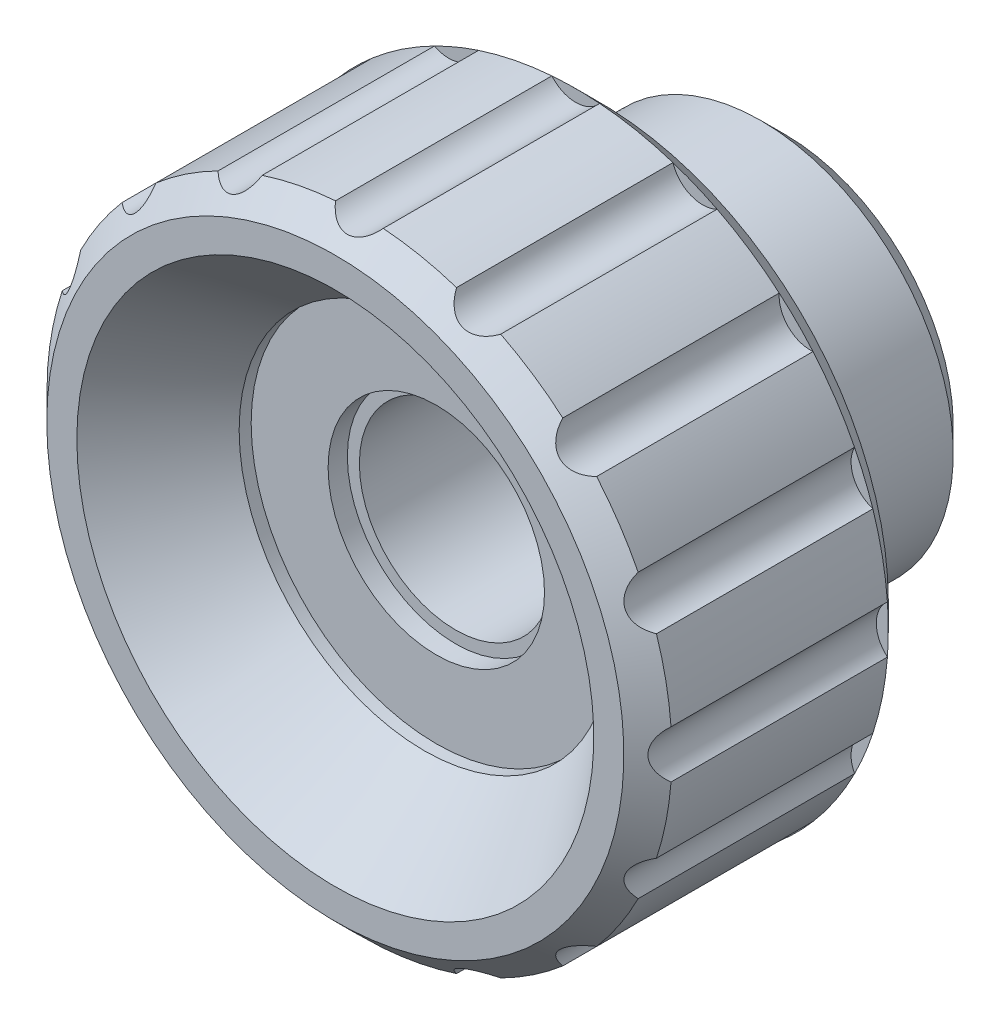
ISO-10303-21;
HEADER;
FILE_DESCRIPTION(('STEP AP214'),'2;1');
FILE_NAME('part.step','',(''),(''),'','','');
FILE_SCHEMA(('AUTOMOTIVE_DESIGN { 1 0 10303 214 1 1 1 1 }'));
ENDSEC;
DATA;
#1=APPLICATION_CONTEXT('core data for automotive mechanical design processes');
#2=APPLICATION_PROTOCOL_DEFINITION('international standard','automotive_design',2000,#1);
#3=PRODUCT_CONTEXT('',#1,'mechanical');
#4=PRODUCT('Part','Part','',(#3));
#5=PRODUCT_RELATED_PRODUCT_CATEGORY('part','',(#4));
#6=PRODUCT_DEFINITION_FORMATION('','',#4);
#7=PRODUCT_DEFINITION_CONTEXT('part definition',#1,'design');
#8=PRODUCT_DEFINITION('design','',#6,#7);
#9=PRODUCT_DEFINITION_SHAPE('','',#8);
#10=(LENGTH_UNIT() NAMED_UNIT(*) SI_UNIT(.MILLI.,.METRE.));
#11=(NAMED_UNIT(*) PLANE_ANGLE_UNIT() SI_UNIT($,.RADIAN.));
#12=(NAMED_UNIT(*) SI_UNIT($,.STERADIAN.) SOLID_ANGLE_UNIT());
#13=UNCERTAINTY_MEASURE_WITH_UNIT(LENGTH_MEASURE(1.E-05),#10,'distance_accuracy_value','');
#14=(GEOMETRIC_REPRESENTATION_CONTEXT(3) GLOBAL_UNCERTAINTY_ASSIGNED_CONTEXT((#13)) GLOBAL_UNIT_ASSIGNED_CONTEXT((#10,
#11,#12)) REPRESENTATION_CONTEXT('',''));
#15=CARTESIAN_POINT('',(0.,0.,0.));
#16=DIRECTION('',(0.,0.,1.));
#17=DIRECTION('',(1.,0.,0.));
#18=AXIS2_PLACEMENT_3D('',#15,#16,#17);
#19=CARTESIAN_POINT('',(-1.51981051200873E-12,-1.30740325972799E-12,19.000000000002));
#20=DIRECTION('',(0.,0.,-1.));
#21=DIRECTION('',(-1.,0.,0.));
#22=AXIS2_PLACEMENT_3D('',#19,#20,#21);
#23=CYLINDRICAL_SURFACE('',#22,4.);
#24=CARTESIAN_POINT('',(0.,0.,0.499999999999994));
#25=DIRECTION('',(0.,0.,-1.));
#26=DIRECTION('',(-1.,0.,0.));
#27=AXIS2_PLACEMENT_3D('',#24,#25,#26);
#28=CIRCLE('',#27,4.);
#29=CARTESIAN_POINT('',(-4.00000000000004,0.,0.499999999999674));
#30=VERTEX_POINT('',#29);
#31=EDGE_CURVE('E24',#30,#30,#28,.T.);
#32=ORIENTED_EDGE('',*,*,#31,.T.);
#33=EDGE_LOOP('',(#32));
#34=FACE_BOUND('',#33,.T.);
#35=CARTESIAN_POINT('',(-1.11986037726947E-12,-9.63349770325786E-13,14.));
#36=DIRECTION('',(0.,0.,1.));
#37=DIRECTION('',(1.,0.,0.));
#38=AXIS2_PLACEMENT_3D('',#35,#36,#37);
#39=CIRCLE('',#38,4.);
#40=CARTESIAN_POINT('',(3.99999999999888,-9.63349770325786E-13,14.));
#41=VERTEX_POINT('',#40);
#42=EDGE_CURVE('E19',#41,#41,#39,.F.);
#43=ORIENTED_EDGE('',*,*,#42,.F.);
#44=EDGE_LOOP('',(#43));
#45=FACE_BOUND('',#44,.T.);
#46=ADVANCED_FACE('F14',(#34,#45),#23,.F.);
#47=CARTESIAN_POINT('',(0.,0.,0.));
#48=DIRECTION('',(0.,0.,-1.));
#49=DIRECTION('',(-1.,0.,0.));
#50=AXIS2_PLACEMENT_3D('',#47,#48,#49);
#51=CYLINDRICAL_SURFACE('',#50,13.);
#52=DIRECTION('',(0.,0.,1.));
#53=VECTOR('',#52,1.);
#54=CARTESIAN_POINT('',(-5.87849826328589,-11.5949669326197,14.));
#55=LINE('',#54,#53);
#56=CARTESIAN_POINT('',(-5.87849826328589,-11.5949669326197,18.));
#57=VERTEX_POINT('',#56);
#58=CARTESIAN_POINT('',(-5.87849826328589,-11.5949669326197,9.));
#59=VERTEX_POINT('',#58);
#60=EDGE_CURVE('E622',#57,#59,#55,.F.);
#61=ORIENTED_EDGE('',*,*,#60,.F.);
#62=CARTESIAN_POINT('',(0.,0.,18.));
#63=DIRECTION('',(0.,0.,-1.));
#64=DIRECTION('',(-1.,0.,0.));
#65=AXIS2_PLACEMENT_3D('',#62,#63,#64);
#66=CIRCLE('',#65,13.);
#67=CARTESIAN_POINT('',(-8.46274873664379,-9.86822597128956,18.));
#68=VERTEX_POINT('',#67);
#69=EDGE_CURVE('E640',#57,#68,#66,.T.);
#70=ORIENTED_EDGE('',*,*,#69,.T.);
#71=DIRECTION('',(0.,0.,1.));
#72=VECTOR('',#71,1.);
#73=CARTESIAN_POINT('',(-8.46274873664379,-9.86822597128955,14.));
#74=LINE('',#73,#72);
#75=CARTESIAN_POINT('',(-8.46274873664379,-9.86822597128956,9.));
#76=VERTEX_POINT('',#75);
#77=EDGE_CURVE('E616',#76,#68,#74,.T.);
#78=ORIENTED_EDGE('',*,*,#77,.F.);
#79=CARTESIAN_POINT('',(0.,0.,9.00000000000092));
#80=DIRECTION('',(0.,0.,-1.));
#81=DIRECTION('',(-1.,0.,0.));
#82=AXIS2_PLACEMENT_3D('',#79,#80,#81);
#83=CIRCLE('',#82,13.);
#84=EDGE_CURVE('E733',#59,#76,#83,.T.);
#85=ORIENTED_EDGE('',*,*,#84,.F.);
#86=EDGE_LOOP('',(#61,#70,#78,#85));
#87=FACE_BOUND('',#86,.T.);
#88=ADVANCED_FACE('F320',(#87),#51,.T.);
#89=DIRECTION('',(0.,0.,1.));
#90=VECTOR('',#89,1.);
#91=CARTESIAN_POINT('',(-9.86822597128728,-8.46274873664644,14.));
#92=LINE('',#91,#90);
#93=CARTESIAN_POINT('',(-9.8682259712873,-8.46274873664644,18.));
#94=VERTEX_POINT('',#93);
#95=CARTESIAN_POINT('',(-9.86822597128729,-8.46274873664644,9.));
#96=VERTEX_POINT('',#95);
#97=EDGE_CURVE('E618',#94,#96,#92,.F.);
#98=ORIENTED_EDGE('',*,*,#97,.F.);
#99=CARTESIAN_POINT('',(-11.5949669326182,-5.87849826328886,18.));
#100=VERTEX_POINT('',#99);
#101=EDGE_CURVE('E635',#94,#100,#66,.T.);
#102=ORIENTED_EDGE('',*,*,#101,.T.);
#103=DIRECTION('',(0.,0.,1.));
#104=VECTOR('',#103,1.);
#105=CARTESIAN_POINT('',(-11.5949669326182,-5.87849826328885,14.));
#106=LINE('',#105,#104);
#107=CARTESIAN_POINT('',(-11.5949669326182,-5.87849826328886,9.));
#108=VERTEX_POINT('',#107);
#109=EDGE_CURVE('E39',#108,#100,#106,.T.);
#110=ORIENTED_EDGE('',*,*,#109,.F.);
#111=EDGE_CURVE('E727',#96,#108,#83,.T.);
#112=ORIENTED_EDGE('',*,*,#111,.F.);
#113=EDGE_LOOP('',(#98,#102,#110,#112));
#114=FACE_BOUND('',#113,.T.);
#115=ADVANCED_FACE('F327',(#114),#51,.T.);
#116=DIRECTION('',(0.,0.,1.));
#117=VECTOR('',#116,1.);
#118=CARTESIAN_POINT('',(-12.3556057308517,-4.04215376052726,14.));
#119=LINE('',#118,#117);
#120=CARTESIAN_POINT('',(-12.3556057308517,-4.04215376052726,18.));
#121=VERTEX_POINT('',#120);
#122=CARTESIAN_POINT('',(-12.3556057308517,-4.04215376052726,9.));
#123=VERTEX_POINT('',#122);
#124=EDGE_CURVE('E614',#121,#123,#119,.F.);
#125=ORIENTED_EDGE('',*,*,#124,.F.);
#126=CARTESIAN_POINT('',(-12.9619565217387,-0.993822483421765,18.));
#127=VERTEX_POINT('',#126);
#128=EDGE_CURVE('E631',#121,#127,#66,.T.);
#129=ORIENTED_EDGE('',*,*,#128,.T.);
#130=DIRECTION('',(0.,0.,1.));
#131=VECTOR('',#130,1.);
#132=CARTESIAN_POINT('',(-12.9619565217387,-0.993822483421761,14.));
#133=LINE('',#132,#131);
#134=CARTESIAN_POINT('',(-12.9619565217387,-0.993822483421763,9.));
#135=VERTEX_POINT('',#134);
#136=EDGE_CURVE('E31',#135,#127,#133,.T.);
#137=ORIENTED_EDGE('',*,*,#136,.F.);
#138=EDGE_CURVE('E648',#123,#135,#83,.T.);
#139=ORIENTED_EDGE('',*,*,#138,.F.);
#140=EDGE_LOOP('',(#125,#129,#137,#139));
#141=FACE_BOUND('',#140,.T.);
#142=ADVANCED_FACE('F1087',(#141),#51,.T.);
#143=DIRECTION('',(0.,0.,1.));
#144=VECTOR('',#143,1.);
#145=CARTESIAN_POINT('',(-12.9619565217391,0.993822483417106,14.));
#146=LINE('',#145,#144);
#147=CARTESIAN_POINT('',(-12.9619565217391,0.993822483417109,18.));
#148=VERTEX_POINT('',#147);
#149=CARTESIAN_POINT('',(-12.9619565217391,0.993822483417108,9.));
#150=VERTEX_POINT('',#149);
#151=EDGE_CURVE('E611',#148,#150,#146,.F.);
#152=ORIENTED_EDGE('',*,*,#151,.F.);
#153=CARTESIAN_POINT('',(-12.355605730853,4.04215376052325,18.));
#154=VERTEX_POINT('',#153);
#155=EDGE_CURVE('E268',#148,#154,#66,.T.);
#156=ORIENTED_EDGE('',*,*,#155,.T.);
#157=DIRECTION('',(0.,0.,1.));
#158=VECTOR('',#157,1.);
#159=CARTESIAN_POINT('',(-12.355605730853,4.04215376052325,14.));
#160=LINE('',#159,#158);
#161=CARTESIAN_POINT('',(-12.355605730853,4.04215376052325,9.));
#162=VERTEX_POINT('',#161);
#163=EDGE_CURVE('E606',#162,#154,#160,.T.);
#164=ORIENTED_EDGE('',*,*,#163,.F.);
#165=EDGE_CURVE('E262',#150,#162,#83,.T.);
#166=ORIENTED_EDGE('',*,*,#165,.F.);
#167=EDGE_LOOP('',(#152,#156,#164,#166));
#168=FACE_BOUND('',#167,.T.);
#169=ADVANCED_FACE('F1080',(#168),#51,.T.);
#170=DIRECTION('',(0.,0.,1.));
#171=VECTOR('',#170,1.);
#172=CARTESIAN_POINT('',(-11.5949669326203,5.87849826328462,14.));
#173=LINE('',#172,#171);
#174=CARTESIAN_POINT('',(-11.5949669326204,5.87849826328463,18.));
#175=VERTEX_POINT('',#174);
#176=CARTESIAN_POINT('',(-11.5949669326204,5.87849826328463,9.));
#177=VERTEX_POINT('',#176);
#178=EDGE_CURVE('E608',#175,#177,#173,.F.);
#179=ORIENTED_EDGE('',*,*,#178,.F.);
#180=CARTESIAN_POINT('',(-9.8682259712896,8.46274873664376,18.));
#181=VERTEX_POINT('',#180);
#182=EDGE_CURVE('E642',#175,#181,#66,.T.);
#183=ORIENTED_EDGE('',*,*,#182,.T.);
#184=DIRECTION('',(0.,0.,1.));
#185=VECTOR('',#184,1.);
#186=CARTESIAN_POINT('',(-9.86822597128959,8.46274873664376,14.));
#187=LINE('',#186,#185);
#188=CARTESIAN_POINT('',(-9.8682259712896,8.46274873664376,9.));
#189=VERTEX_POINT('',#188);
#190=EDGE_CURVE('E602',#189,#181,#187,.T.);
#191=ORIENTED_EDGE('',*,*,#190,.F.);
#192=EDGE_CURVE('E1298',#177,#189,#83,.T.);
#193=ORIENTED_EDGE('',*,*,#192,.F.);
#194=EDGE_LOOP('',(#179,#183,#191,#193));
#195=FACE_BOUND('',#194,.T.);
#196=ADVANCED_FACE('F1070',(#195),#51,.T.);
#197=DIRECTION('',(0.,0.,1.));
#198=VECTOR('',#197,1.);
#199=CARTESIAN_POINT('',(-8.46274873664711,9.86822597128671,14.));
#200=LINE('',#199,#198);
#201=CARTESIAN_POINT('',(-8.46274873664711,9.86822597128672,18.));
#202=VERTEX_POINT('',#201);
#203=CARTESIAN_POINT('',(-8.46274873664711,9.86822597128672,9.));
#204=VERTEX_POINT('',#203);
#205=EDGE_CURVE('E604',#202,#204,#200,.F.);
#206=ORIENTED_EDGE('',*,*,#205,.F.);
#207=CARTESIAN_POINT('',(-5.87849826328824,11.5949669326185,18.));
#208=VERTEX_POINT('',#207);
#209=EDGE_CURVE('E650',#202,#208,#66,.T.);
#210=ORIENTED_EDGE('',*,*,#209,.T.);
#211=DIRECTION('',(0.,0.,1.));
#212=VECTOR('',#211,1.);
#213=CARTESIAN_POINT('',(-5.87849826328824,11.5949669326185,14.));
#214=LINE('',#213,#212);
#215=CARTESIAN_POINT('',(-5.87849826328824,11.5949669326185,9.));
#216=VERTEX_POINT('',#215);
#217=EDGE_CURVE('E598',#216,#208,#214,.T.);
#218=ORIENTED_EDGE('',*,*,#217,.F.);
#219=EDGE_CURVE('E1292',#204,#216,#83,.T.);
#220=ORIENTED_EDGE('',*,*,#219,.F.);
#221=EDGE_LOOP('',(#206,#210,#218,#220));
#222=FACE_BOUND('',#221,.T.);
#223=ADVANCED_FACE('F1063',(#222),#51,.T.);
#224=DIRECTION('',(0.,0.,1.));
#225=VECTOR('',#224,1.);
#226=CARTESIAN_POINT('',(-4.04215376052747,12.3556057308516,14.));
#227=LINE('',#226,#225);
#228=CARTESIAN_POINT('',(-4.04215376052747,12.3556057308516,18.));
#229=VERTEX_POINT('',#228);
#230=CARTESIAN_POINT('',(-4.04215376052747,12.3556057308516,9.));
#231=VERTEX_POINT('',#230);
#232=EDGE_CURVE('E600',#229,#231,#227,.F.);
#233=ORIENTED_EDGE('',*,*,#232,.F.);
#234=CARTESIAN_POINT('',(-0.99382248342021,12.9619565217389,18.));
#235=VERTEX_POINT('',#234);
#236=EDGE_CURVE('E656',#229,#235,#66,.T.);
#237=ORIENTED_EDGE('',*,*,#236,.T.);
#238=DIRECTION('',(0.,0.,1.));
#239=VECTOR('',#238,1.);
#240=CARTESIAN_POINT('',(-0.993822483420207,12.9619565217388,14.));
#241=LINE('',#240,#239);
#242=CARTESIAN_POINT('',(-0.993822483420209,12.9619565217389,9.));
#243=VERTEX_POINT('',#242);
#244=EDGE_CURVE('E594',#243,#235,#241,.T.);
#245=ORIENTED_EDGE('',*,*,#244,.F.);
#246=EDGE_CURVE('E261',#231,#243,#83,.T.);
#247=ORIENTED_EDGE('',*,*,#246,.F.);
#248=EDGE_LOOP('',(#233,#237,#245,#247));
#249=FACE_BOUND('',#248,.T.);
#250=ADVANCED_FACE('F832',(#249),#51,.T.);
#251=DIRECTION('',(0.,0.,1.));
#252=VECTOR('',#251,1.);
#253=CARTESIAN_POINT('',(0.993822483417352,12.9619565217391,14.));
#254=LINE('',#253,#252);
#255=CARTESIAN_POINT('',(0.993822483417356,12.9619565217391,18.));
#256=VERTEX_POINT('',#255);
#257=CARTESIAN_POINT('',(0.993822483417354,12.9619565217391,9.));
#258=VERTEX_POINT('',#257);
#259=EDGE_CURVE('E596',#256,#258,#254,.F.);
#260=ORIENTED_EDGE('',*,*,#259,.F.);
#261=CARTESIAN_POINT('',(4.04215376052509,12.3556057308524,18.));
#262=VERTEX_POINT('',#261);
#263=EDGE_CURVE('E254',#256,#262,#66,.T.);
#264=ORIENTED_EDGE('',*,*,#263,.T.);
#265=DIRECTION('',(0.,0.,1.));
#266=VECTOR('',#265,1.);
#267=CARTESIAN_POINT('',(4.04215376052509,12.3556057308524,14.));
#268=LINE('',#267,#266);
#269=CARTESIAN_POINT('',(4.04215376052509,12.3556057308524,9.));
#270=VERTEX_POINT('',#269);
#271=EDGE_CURVE('E241',#270,#262,#268,.T.);
#272=ORIENTED_EDGE('',*,*,#271,.F.);
#273=EDGE_CURVE('E235',#258,#270,#83,.T.);
#274=ORIENTED_EDGE('',*,*,#273,.F.);
#275=EDGE_LOOP('',(#260,#264,#272,#274));
#276=FACE_BOUND('',#275,.T.);
#277=ADVANCED_FACE('F251',(#276),#51,.T.);
#278=DIRECTION('',(0.,0.,1.));
#279=VECTOR('',#278,1.);
#280=CARTESIAN_POINT('',(-4.04215376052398,-12.3556057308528,14.));
#281=LINE('',#280,#279);
#282=CARTESIAN_POINT('',(-4.04215376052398,-12.3556057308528,9.));
#283=VERTEX_POINT('',#282);
#284=CARTESIAN_POINT('',(-4.04215376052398,-12.3556057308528,18.));
#285=VERTEX_POINT('',#284);
#286=EDGE_CURVE('E620',#283,#285,#281,.T.);
#287=ORIENTED_EDGE('',*,*,#286,.F.);
#288=CARTESIAN_POINT('',(-0.993822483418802,-12.961956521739,9.));
#289=VERTEX_POINT('',#288);
#290=EDGE_CURVE('E735',#289,#283,#83,.T.);
#291=ORIENTED_EDGE('',*,*,#290,.F.);
#292=DIRECTION('',(0.,0.,1.));
#293=VECTOR('',#292,1.);
#294=CARTESIAN_POINT('',(-0.993822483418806,-12.961956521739,14.));
#295=LINE('',#294,#293);
#296=CARTESIAN_POINT('',(-0.993822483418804,-12.961956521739,18.));
#297=VERTEX_POINT('',#296);
#298=EDGE_CURVE('E592',#297,#289,#295,.F.);
#299=ORIENTED_EDGE('',*,*,#298,.F.);
#300=EDGE_CURVE('E703',#297,#285,#66,.T.);
#301=ORIENTED_EDGE('',*,*,#300,.T.);
#302=EDGE_LOOP('',(#287,#291,#299,#301));
#303=FACE_BOUND('',#302,.T.);
#304=ADVANCED_FACE('F823',(#303),#51,.T.);
#305=DIRECTION('',(0.,0.,1.));
#306=VECTOR('',#305,1.);
#307=CARTESIAN_POINT('',(0.993822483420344,-12.9619565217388,14.));
#308=LINE('',#307,#306);
#309=CARTESIAN_POINT('',(0.993822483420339,-12.9619565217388,9.));
#310=VERTEX_POINT('',#309);
#311=CARTESIAN_POINT('',(0.993822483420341,-12.9619565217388,18.));
#312=VERTEX_POINT('',#311);
#313=EDGE_CURVE('E590',#310,#312,#308,.T.);
#314=ORIENTED_EDGE('',*,*,#313,.F.);
#315=CARTESIAN_POINT('',(4.04215376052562,-12.3556057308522,9.));
#316=VERTEX_POINT('',#315);
#317=EDGE_CURVE('E740',#316,#310,#83,.T.);
#318=ORIENTED_EDGE('',*,*,#317,.F.);
#319=DIRECTION('',(0.,0.,1.));
#320=VECTOR('',#319,1.);
#321=CARTESIAN_POINT('',(4.04215376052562,-12.3556057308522,14.));
#322=LINE('',#321,#320);
#323=CARTESIAN_POINT('',(4.04215376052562,-12.3556057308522,18.));
#324=VERTEX_POINT('',#323);
#325=EDGE_CURVE('E588',#324,#316,#322,.F.);
#326=ORIENTED_EDGE('',*,*,#325,.F.);
#327=EDGE_CURVE('E697',#324,#312,#66,.T.);
#328=ORIENTED_EDGE('',*,*,#327,.T.);
#329=EDGE_LOOP('',(#314,#318,#326,#328));
#330=FACE_BOUND('',#329,.T.);
#331=ADVANCED_FACE('F821',(#330),#51,.T.);
#332=DIRECTION('',(0.,0.,1.));
#333=VECTOR('',#332,1.);
#334=CARTESIAN_POINT('',(5.87849826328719,-11.5949669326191,14.));
#335=LINE('',#334,#333);
#336=CARTESIAN_POINT('',(5.87849826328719,-11.5949669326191,9.));
#337=VERTEX_POINT('',#336);
#338=CARTESIAN_POINT('',(5.87849826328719,-11.5949669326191,18.));
#339=VERTEX_POINT('',#338);
#340=EDGE_CURVE('E586',#337,#339,#335,.T.);
#341=ORIENTED_EDGE('',*,*,#340,.F.);
#342=CARTESIAN_POINT('',(8.46274873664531,-9.86822597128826,9.));
#343=VERTEX_POINT('',#342);
#344=EDGE_CURVE('E745',#343,#337,#83,.T.);
#345=ORIENTED_EDGE('',*,*,#344,.F.);
#346=DIRECTION('',(0.,0.,1.));
#347=VECTOR('',#346,1.);
#348=CARTESIAN_POINT('',(8.46274873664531,-9.86822597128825,14.));
#349=LINE('',#348,#347);
#350=CARTESIAN_POINT('',(8.46274873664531,-9.86822597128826,18.));
#351=VERTEX_POINT('',#350);
#352=EDGE_CURVE('E584',#351,#343,#349,.F.);
#353=ORIENTED_EDGE('',*,*,#352,.F.);
#354=EDGE_CURVE('E691',#351,#339,#66,.T.);
#355=ORIENTED_EDGE('',*,*,#354,.T.);
#356=EDGE_LOOP('',(#341,#345,#353,#355));
#357=FACE_BOUND('',#356,.T.);
#358=ADVANCED_FACE('F831',(#357),#51,.T.);
#359=DIRECTION('',(0.,0.,1.));
#360=VECTOR('',#359,1.);
#361=CARTESIAN_POINT('',(9.86822597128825,-8.46274873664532,14.));
#362=LINE('',#361,#360);
#363=CARTESIAN_POINT('',(9.86822597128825,-8.46274873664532,9.));
#364=VERTEX_POINT('',#363);
#365=CARTESIAN_POINT('',(9.86822597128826,-8.46274873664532,18.));
#366=VERTEX_POINT('',#365);
#367=EDGE_CURVE('E582',#364,#366,#362,.T.);
#368=ORIENTED_EDGE('',*,*,#367,.F.);
#369=CARTESIAN_POINT('',(11.5949669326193,-5.87849826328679,9.));
#370=VERTEX_POINT('',#369);
#371=EDGE_CURVE('E750',#370,#364,#83,.T.);
#372=ORIENTED_EDGE('',*,*,#371,.F.);
#373=DIRECTION('',(0.,0.,1.));
#374=VECTOR('',#373,1.);
#375=CARTESIAN_POINT('',(11.5949669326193,-5.87849826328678,14.));
#376=LINE('',#375,#374);
#377=CARTESIAN_POINT('',(11.5949669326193,-5.87849826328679,18.));
#378=VERTEX_POINT('',#377);
#379=EDGE_CURVE('E580',#378,#370,#376,.F.);
#380=ORIENTED_EDGE('',*,*,#379,.F.);
#381=EDGE_CURVE('E685',#378,#366,#66,.T.);
#382=ORIENTED_EDGE('',*,*,#381,.T.);
#383=EDGE_LOOP('',(#368,#372,#380,#382));
#384=FACE_BOUND('',#383,.T.);
#385=ADVANCED_FACE('F1047',(#384),#51,.T.);
#386=DIRECTION('',(0.,0.,1.));
#387=VECTOR('',#386,1.);
#388=CARTESIAN_POINT('',(12.3556057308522,-4.04215376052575,14.));
#389=LINE('',#388,#387);
#390=CARTESIAN_POINT('',(12.3556057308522,-4.04215376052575,9.));
#391=VERTEX_POINT('',#390);
#392=CARTESIAN_POINT('',(12.3556057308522,-4.04215376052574,18.));
#393=VERTEX_POINT('',#392);
#394=EDGE_CURVE('E578',#391,#393,#389,.T.);
#395=ORIENTED_EDGE('',*,*,#394,.F.);
#396=CARTESIAN_POINT('',(12.9619565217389,-0.993822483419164,9.));
#397=VERTEX_POINT('',#396);
#398=EDGE_CURVE('E755',#397,#391,#83,.T.);
#399=ORIENTED_EDGE('',*,*,#398,.F.);
#400=DIRECTION('',(0.,0.,1.));
#401=VECTOR('',#400,1.);
#402=CARTESIAN_POINT('',(12.9619565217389,-0.993822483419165,14.));
#403=LINE('',#402,#401);
#404=CARTESIAN_POINT('',(12.9619565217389,-0.993822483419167,18.));
#405=VERTEX_POINT('',#404);
#406=EDGE_CURVE('E576',#405,#397,#403,.F.);
#407=ORIENTED_EDGE('',*,*,#406,.F.);
#408=EDGE_CURVE('E679',#405,#393,#66,.T.);
#409=ORIENTED_EDGE('',*,*,#408,.T.);
#410=EDGE_LOOP('',(#395,#399,#407,#409));
#411=FACE_BOUND('',#410,.T.);
#412=ADVANCED_FACE('F1039',(#411),#51,.T.);
#413=DIRECTION('',(0.,0.,1.));
#414=VECTOR('',#413,1.);
#415=CARTESIAN_POINT('',(12.961956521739,0.993822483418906,14.));
#416=LINE('',#415,#414);
#417=CARTESIAN_POINT('',(12.961956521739,0.993822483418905,9.));
#418=VERTEX_POINT('',#417);
#419=CARTESIAN_POINT('',(12.961956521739,0.993822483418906,18.));
#420=VERTEX_POINT('',#419);
#421=EDGE_CURVE('E574',#418,#420,#416,.T.);
#422=ORIENTED_EDGE('',*,*,#421,.F.);
#423=CARTESIAN_POINT('',(12.3556057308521,4.04215376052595,9.));
#424=VERTEX_POINT('',#423);
#425=EDGE_CURVE('E760',#424,#418,#83,.T.);
#426=ORIENTED_EDGE('',*,*,#425,.F.);
#427=DIRECTION('',(0.,0.,1.));
#428=VECTOR('',#427,1.);
#429=CARTESIAN_POINT('',(12.3556057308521,4.04215376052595,14.));
#430=LINE('',#429,#428);
#431=CARTESIAN_POINT('',(12.3556057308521,4.04215376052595,18.));
#432=VERTEX_POINT('',#431);
#433=EDGE_CURVE('E572',#432,#424,#430,.F.);
#434=ORIENTED_EDGE('',*,*,#433,.F.);
#435=EDGE_CURVE('E673',#432,#420,#66,.T.);
#436=ORIENTED_EDGE('',*,*,#435,.T.);
#437=EDGE_LOOP('',(#422,#426,#434,#436));
#438=FACE_BOUND('',#437,.T.);
#439=ADVANCED_FACE('F1032',(#438),#51,.T.);
#440=DIRECTION('',(0.,0.,1.));
#441=VECTOR('',#440,1.);
#442=CARTESIAN_POINT('',(11.5949669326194,5.87849826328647,14.));
#443=LINE('',#442,#441);
#444=CARTESIAN_POINT('',(11.5949669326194,5.87849826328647,9.));
#445=VERTEX_POINT('',#444);
#446=CARTESIAN_POINT('',(11.5949669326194,5.87849826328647,18.));
#447=VERTEX_POINT('',#446);
#448=EDGE_CURVE('E570',#445,#447,#443,.T.);
#449=ORIENTED_EDGE('',*,*,#448,.F.);
#450=CARTESIAN_POINT('',(9.86822597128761,8.46274873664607,9.));
#451=VERTEX_POINT('',#450);
#452=EDGE_CURVE('E765',#451,#445,#83,.T.);
#453=ORIENTED_EDGE('',*,*,#452,.F.);
#454=DIRECTION('',(0.,0.,1.));
#455=VECTOR('',#454,1.);
#456=CARTESIAN_POINT('',(9.86822597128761,8.46274873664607,14.));
#457=LINE('',#456,#455);
#458=CARTESIAN_POINT('',(9.86822597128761,8.46274873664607,18.));
#459=VERTEX_POINT('',#458);
#460=EDGE_CURVE('E568',#459,#451,#457,.F.);
#461=ORIENTED_EDGE('',*,*,#460,.F.);
#462=EDGE_CURVE('E668',#459,#447,#66,.T.);
#463=ORIENTED_EDGE('',*,*,#462,.T.);
#464=EDGE_LOOP('',(#449,#453,#461,#463));
#465=FACE_BOUND('',#464,.T.);
#466=ADVANCED_FACE('F835',(#465),#51,.T.);
#467=CARTESIAN_POINT('',(7.,0.,0.30000000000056));
#468=DIRECTION('',(0.,0.,-1.));
#469=DIRECTION('',(0.,1.,0.));
#470=AXIS2_PLACEMENT_3D('',#467,#468,#469);
#471=PLANE('',#470);
#472=CARTESIAN_POINT('',(0.,0.,0.3));
#473=DIRECTION('',(0.,0.,-1.));
#474=DIRECTION('',(-1.,0.,0.));
#475=AXIS2_PLACEMENT_3D('',#472,#473,#474);
#476=CIRCLE('',#475,4.8);
#477=CARTESIAN_POINT('',(-4.80000000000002,0.,0.299999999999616));
#478=VERTEX_POINT('',#477);
#479=EDGE_CURVE('E490',#478,#478,#476,.T.);
#480=ORIENTED_EDGE('',*,*,#479,.F.);
#481=EDGE_LOOP('',(#480));
#482=FACE_BOUND('',#481,.T.);
#483=CARTESIAN_POINT('',(0.,0.,0.3));
#484=DIRECTION('',(0.,0.,-1.));
#485=DIRECTION('',(0.,1.,0.));
#486=AXIS2_PLACEMENT_3D('',#483,#484,#485);
#487=CIRCLE('',#486,7.);
#488=CARTESIAN_POINT('',(0.,6.99999999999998,0.300000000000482));
#489=VERTEX_POINT('',#488);
#490=EDGE_CURVE('E272',#489,#489,#487,.T.);
#491=ORIENTED_EDGE('',*,*,#490,.T.);
#492=EDGE_LOOP('',(#491));
#493=FACE_BOUND('',#492,.T.);
#494=ADVANCED_FACE('F838',(#482,#493),#471,.T.);
#495=CARTESIAN_POINT('',(-1.18385239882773E-12,-1.01839832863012E-12,14.8));
#496=DIRECTION('',(0.,0.,1.));
#497=DIRECTION('',(0.,-1.,0.));
#498=AXIS2_PLACEMENT_3D('',#495,#496,#497);
#499=PLANE('',#498);
#500=CARTESIAN_POINT('',(0.,0.,14.8));
#501=DIRECTION('',(0.,0.,1.));
#502=DIRECTION('',(1.,0.,0.));
#503=AXIS2_PLACEMENT_3D('',#500,#501,#502);
#504=CIRCLE('',#503,4.5);
#505=CARTESIAN_POINT('',(4.5,0.,14.8));
#506=VERTEX_POINT('',#505);
#507=EDGE_CURVE('E523',#506,#506,#504,.T.);
#508=ORIENTED_EDGE('',*,*,#507,.F.);
#509=EDGE_LOOP('',(#508));
#510=FACE_BOUND('',#509,.T.);
#511=CARTESIAN_POINT('',(-1.18385239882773E-12,-1.01839832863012E-12,14.8));
#512=DIRECTION('',(0.,0.,-1.));
#513=DIRECTION('',(0.,1.,0.));
#514=AXIS2_PLACEMENT_3D('',#511,#512,#513);
#515=CIRCLE('',#514,7.7);
#516=CARTESIAN_POINT('',(-1.18385239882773E-12,7.69999999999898,14.8000000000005));
#517=VERTEX_POINT('',#516);
#518=EDGE_CURVE('E281',#517,#517,#515,.T.);
#519=ORIENTED_EDGE('',*,*,#518,.F.);
#520=EDGE_LOOP('',(#519));
#521=FACE_BOUND('',#520,.T.);
#522=ADVANCED_FACE('F841',(#510,#521),#499,.T.);
#523=CARTESIAN_POINT('',(0.,0.,0.3));
#524=DIRECTION('',(0.,0.,-1.));
#525=DIRECTION('',(0.,1.,0.));
#526=AXIS2_PLACEMENT_3D('',#523,#524,#525);
#527=CYLINDRICAL_SURFACE('',#526,7.7);
#528=ORIENTED_EDGE('',*,*,#518,.T.);
#529=EDGE_LOOP('',(#528));
#530=FACE_BOUND('',#529,.T.);
#531=CARTESIAN_POINT('',(0.,0.,15.2999999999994));
#532=DIRECTION('',(0.,0.,-1.));
#533=DIRECTION('',(-1.,0.,0.));
#534=AXIS2_PLACEMENT_3D('',#531,#532,#533);
#535=CIRCLE('',#534,7.70000000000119);
#536=CARTESIAN_POINT('',(-7.70000000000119,0.,15.2999999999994));
#537=VERTEX_POINT('',#536);
#538=EDGE_CURVE('E624',#537,#537,#535,.T.);
#539=ORIENTED_EDGE('',*,*,#538,.F.);
#540=EDGE_LOOP('',(#539));
#541=FACE_BOUND('',#540,.T.);
#542=ADVANCED_FACE('F857',(#530,#541),#527,.F.);
#543=CARTESIAN_POINT('',(10.2499999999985,-1.30740325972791E-12,19.0000000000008));
#544=DIRECTION('',(0.,0.,1.));
#545=DIRECTION('',(0.,-1.,0.));
#546=AXIS2_PLACEMENT_3D('',#543,#544,#545);
#547=PLANE('',#546);
#548=CARTESIAN_POINT('',(0.,0.,18.9999999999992));
#549=DIRECTION('',(0.,0.,-1.));
#550=DIRECTION('',(-1.,0.,0.));
#551=AXIS2_PLACEMENT_3D('',#548,#549,#550);
#552=CIRCLE('',#551,10.7500000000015);
#553=CARTESIAN_POINT('',(-10.7500000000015,0.,18.9999999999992));
#554=VERTEX_POINT('',#553);
#555=EDGE_CURVE('E627',#554,#554,#552,.T.);
#556=ORIENTED_EDGE('',*,*,#555,.T.);
#557=EDGE_LOOP('',(#556));
#558=FACE_BOUND('',#557,.T.);
#559=CARTESIAN_POINT('',(0.,0.,19.));
#560=DIRECTION('',(0.,0.,-1.));
#561=DIRECTION('',(-1.,0.,0.));
#562=AXIS2_PLACEMENT_3D('',#559,#560,#561);
#563=CIRCLE('',#562,12.);
#564=CARTESIAN_POINT('',(-12.,0.,19.));
#565=VERTEX_POINT('',#564);
#566=EDGE_CURVE('E629',#565,#565,#563,.T.);
#567=ORIENTED_EDGE('',*,*,#566,.F.);
#568=EDGE_LOOP('',(#567));
#569=FACE_BOUND('',#568,.T.);
#570=ADVANCED_FACE('F853',(#558,#569),#547,.T.);
#571=CARTESIAN_POINT('',(11.4999999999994,-5.50485583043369E-13,8.00000000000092));
#572=DIRECTION('',(0.,0.,-1.));
#573=DIRECTION('',(0.,1.,0.));
#574=AXIS2_PLACEMENT_3D('',#571,#572,#573);
#575=PLANE('',#574);
#576=CARTESIAN_POINT('',(-6.39920215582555E-13,-5.50485583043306E-13,8.));
#577=DIRECTION('',(0.,0.,-1.));
#578=DIRECTION('',(0.,1.,0.));
#579=AXIS2_PLACEMENT_3D('',#576,#577,#578);
#580=CIRCLE('',#579,8.);
#581=CARTESIAN_POINT('',(-6.39920215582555E-13,7.99999999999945,8.00000000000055));
#582=VERTEX_POINT('',#581);
#583=EDGE_CURVE('E278',#582,#582,#580,.T.);
#584=ORIENTED_EDGE('',*,*,#583,.F.);
#585=EDGE_LOOP('',(#584));
#586=FACE_BOUND('',#585,.T.);
#587=CARTESIAN_POINT('',(0.,0.,8.00000000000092));
#588=DIRECTION('',(0.,0.,-1.));
#589=DIRECTION('',(-1.,0.,0.));
#590=AXIS2_PLACEMENT_3D('',#587,#588,#589);
#591=CIRCLE('',#590,12.0000000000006);
#592=CARTESIAN_POINT('',(-12.0000000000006,0.,8.00000000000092));
#593=VERTEX_POINT('',#592);
#594=EDGE_CURVE('E265',#593,#593,#591,.T.);
#595=ORIENTED_EDGE('',*,*,#594,.T.);
#596=EDGE_LOOP('',(#595));
#597=FACE_BOUND('',#596,.T.);
#598=ADVANCED_FACE('F849',(#586,#597),#575,.T.);
#599=CARTESIAN_POINT('',(0.,0.,0.3));
#600=DIRECTION('',(0.,0.,-1.));
#601=DIRECTION('',(0.,1.,0.));
#602=AXIS2_PLACEMENT_3D('',#599,#600,#601);
#603=CYLINDRICAL_SURFACE('',#602,8.);
#604=ORIENTED_EDGE('',*,*,#583,.T.);
#605=EDGE_LOOP('',(#604));
#606=FACE_BOUND('',#605,.T.);
#607=CARTESIAN_POINT('',(-1.03987035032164E-13,0.,1.3));
#608=DIRECTION('',(0.,0.,-1.));
#609=DIRECTION('',(0.,1.,0.));
#610=AXIS2_PLACEMENT_3D('',#607,#608,#609);
#611=CIRCLE('',#610,8.);
#612=CARTESIAN_POINT('',(-1.03987035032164E-13,7.99999999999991,1.30000000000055));
#613=VERTEX_POINT('',#612);
#614=EDGE_CURVE('E275',#613,#613,#611,.T.);
#615=ORIENTED_EDGE('',*,*,#614,.F.);
#616=EDGE_LOOP('',(#615));
#617=FACE_BOUND('',#616,.T.);
#618=ADVANCED_FACE('F845',(#606,#617),#603,.T.);
#619=CARTESIAN_POINT('',(0.,0.,0.3));
#620=DIRECTION('',(0.,0.,1.));
#621=DIRECTION('',(0.,-1.,0.));
#622=AXIS2_PLACEMENT_3D('',#619,#620,#621);
#623=CONICAL_SURFACE('',#622,7.,0.785398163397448);
#624=ORIENTED_EDGE('',*,*,#614,.T.);
#625=EDGE_LOOP('',(#624));
#626=FACE_BOUND('',#625,.T.);
#627=ORIENTED_EDGE('',*,*,#490,.F.);
#628=EDGE_LOOP('',(#627));
#629=FACE_BOUND('',#628,.T.);
#630=ADVANCED_FACE('F508',(#626,#629),#623,.T.);
#631=CARTESIAN_POINT('',(0.,0.,0.));
#632=DIRECTION('',(0.,0.,-1.));
#633=DIRECTION('',(-1.,0.,0.));
#634=AXIS2_PLACEMENT_3D('',#631,#632,#633);
#635=PLANE('',#634);
#636=CARTESIAN_POINT('',(0.,0.,0.));
#637=DIRECTION('',(0.,0.,-1.));
#638=DIRECTION('',(-1.,0.,0.));
#639=AXIS2_PLACEMENT_3D('',#636,#637,#638);
#640=CIRCLE('',#639,4.5);
#641=CARTESIAN_POINT('',(-4.5,0.,-3.59955121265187E-13));
#642=VERTEX_POINT('',#641);
#643=EDGE_CURVE('E9',#642,#642,#640,.F.);
#644=ORIENTED_EDGE('',*,*,#643,.T.);
#645=EDGE_LOOP('',(#644));
#646=FACE_BOUND('',#645,.T.);
#647=CARTESIAN_POINT('',(0.,0.,0.));
#648=DIRECTION('',(0.,0.,-1.));
#649=DIRECTION('',(-1.,0.,0.));
#650=AXIS2_PLACEMENT_3D('',#647,#648,#649);
#651=CIRCLE('',#650,4.8);
#652=CARTESIAN_POINT('',(-4.8,0.,-3.83952129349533E-13));
#653=VERTEX_POINT('',#652);
#654=EDGE_CURVE('E512',#653,#653,#651,.T.);
#655=ORIENTED_EDGE('',*,*,#654,.T.);
#656=EDGE_LOOP('',(#655));
#657=FACE_BOUND('',#656,.T.);
#658=ADVANCED_FACE('F505',(#646,#657),#635,.T.);
#659=CARTESIAN_POINT('',(0.,0.,8.00000000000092));
#660=DIRECTION('',(0.,0.,1.));
#661=DIRECTION('',(1.,0.,0.));
#662=AXIS2_PLACEMENT_3D('',#659,#660,#661);
#663=CONICAL_SURFACE('',#662,12.0000000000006,0.785398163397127);
#664=ORIENTED_EDGE('',*,*,#165,.T.);
#665=EDGE_CURVE('E266',#162,#177,#83,.T.);
#666=ORIENTED_EDGE('',*,*,#665,.T.);
#667=ORIENTED_EDGE('',*,*,#192,.T.);
#668=EDGE_CURVE('E1290',#189,#204,#83,.T.);
#669=ORIENTED_EDGE('',*,*,#668,.T.);
#670=ORIENTED_EDGE('',*,*,#219,.T.);
#671=EDGE_CURVE('E1294',#216,#231,#83,.T.);
#672=ORIENTED_EDGE('',*,*,#671,.T.);
#673=ORIENTED_EDGE('',*,*,#246,.T.);
#674=EDGE_CURVE('E260',#243,#258,#83,.T.);
#675=ORIENTED_EDGE('',*,*,#674,.T.);
#676=ORIENTED_EDGE('',*,*,#273,.T.);
#677=CARTESIAN_POINT('',(5.87849826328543,11.5949669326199,9.));
#678=VERTEX_POINT('',#677);
#679=EDGE_CURVE('E227',#270,#678,#83,.T.);
#680=ORIENTED_EDGE('',*,*,#679,.T.);
#681=CARTESIAN_POINT('',(8.46274873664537,9.86822597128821,9.));
#682=VERTEX_POINT('',#681);
#683=EDGE_CURVE('E236',#678,#682,#83,.T.);
#684=ORIENTED_EDGE('',*,*,#683,.T.);
#685=EDGE_CURVE('E767',#682,#451,#83,.T.);
#686=ORIENTED_EDGE('',*,*,#685,.T.);
#687=ORIENTED_EDGE('',*,*,#452,.T.);
#688=EDGE_CURVE('E762',#445,#424,#83,.T.);
#689=ORIENTED_EDGE('',*,*,#688,.T.);
#690=ORIENTED_EDGE('',*,*,#425,.T.);
#691=EDGE_CURVE('E757',#418,#397,#83,.T.);
#692=ORIENTED_EDGE('',*,*,#691,.T.);
#693=ORIENTED_EDGE('',*,*,#398,.T.);
#694=EDGE_CURVE('E752',#391,#370,#83,.T.);
#695=ORIENTED_EDGE('',*,*,#694,.T.);
#696=ORIENTED_EDGE('',*,*,#371,.T.);
#697=EDGE_CURVE('E747',#364,#343,#83,.T.);
#698=ORIENTED_EDGE('',*,*,#697,.T.);
#699=ORIENTED_EDGE('',*,*,#344,.T.);
#700=EDGE_CURVE('E742',#337,#316,#83,.T.);
#701=ORIENTED_EDGE('',*,*,#700,.T.);
#702=ORIENTED_EDGE('',*,*,#317,.T.);
#703=EDGE_CURVE('E737',#310,#289,#83,.T.);
#704=ORIENTED_EDGE('',*,*,#703,.T.);
#705=ORIENTED_EDGE('',*,*,#290,.T.);
#706=EDGE_CURVE('E734',#283,#59,#83,.T.);
#707=ORIENTED_EDGE('',*,*,#706,.T.);
#708=ORIENTED_EDGE('',*,*,#84,.T.);
#709=EDGE_CURVE('E730',#76,#96,#83,.T.);
#710=ORIENTED_EDGE('',*,*,#709,.T.);
#711=ORIENTED_EDGE('',*,*,#111,.T.);
#712=EDGE_CURVE('E731',#108,#123,#83,.T.);
#713=ORIENTED_EDGE('',*,*,#712,.T.);
#714=ORIENTED_EDGE('',*,*,#138,.T.);
#715=EDGE_CURVE('E267',#135,#150,#83,.T.);
#716=ORIENTED_EDGE('',*,*,#715,.T.);
#717=EDGE_LOOP('',(#664,#666,#667,#669,#670,#672,#673,#675,#676,#680,#684,#686,#687,#689,#690,
#692,#693,#695,#696,#698,#699,#701,#702,#704,#705,#707,#708,#710,#711,#713,#714,#716));
#718=FACE_BOUND('',#717,.T.);
#719=ORIENTED_EDGE('',*,*,#594,.F.);
#720=EDGE_LOOP('',(#719));
#721=FACE_BOUND('',#720,.T.);
#722=ADVANCED_FACE('F257',(#718,#721),#663,.T.);
#723=DIRECTION('',(0.,0.,1.));
#724=VECTOR('',#723,1.);
#725=CARTESIAN_POINT('',(8.46274873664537,9.86822597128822,14.));
#726=LINE('',#725,#724);
#727=CARTESIAN_POINT('',(8.46274873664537,9.86822597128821,18.));
#728=VERTEX_POINT('',#727);
#729=EDGE_CURVE('E566',#682,#728,#726,.T.);
#730=ORIENTED_EDGE('',*,*,#729,.F.);
#731=ORIENTED_EDGE('',*,*,#683,.F.);
#732=DIRECTION('',(0.,0.,1.));
#733=VECTOR('',#732,1.);
#734=CARTESIAN_POINT('',(5.87849826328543,11.5949669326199,14.));
#735=LINE('',#734,#733);
#736=CARTESIAN_POINT('',(5.87849826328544,11.5949669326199,18.));
#737=VERTEX_POINT('',#736);
#738=EDGE_CURVE('E244',#737,#678,#735,.F.);
#739=ORIENTED_EDGE('',*,*,#738,.F.);
#740=EDGE_CURVE('E666',#737,#728,#66,.T.);
#741=ORIENTED_EDGE('',*,*,#740,.T.);
#742=EDGE_LOOP('',(#730,#731,#739,#741));
#743=FACE_BOUND('',#742,.T.);
#744=ADVANCED_FACE('F315',(#743),#51,.T.);
#745=CARTESIAN_POINT('',(0.,0.,18.));
#746=DIRECTION('',(0.,0.,-1.));
#747=DIRECTION('',(-1.,0.,0.));
#748=AXIS2_PLACEMENT_3D('',#745,#746,#747);
#749=CONICAL_SURFACE('',#748,13.,0.785398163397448);
#750=CARTESIAN_POINT('',(-4.04207910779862,-12.3558405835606,17.9997999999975));
#751=CARTESIAN_POINT('',(-4.05212219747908,-12.3242617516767,18.0266898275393));
#752=CARTESIAN_POINT('',(-4.06346942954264,-12.2927126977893,18.0531049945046));
#753=CARTESIAN_POINT('',(-4.08899012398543,-12.2297291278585,18.1048217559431));
#754=CARTESIAN_POINT('',(-4.10316942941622,-12.1982949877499,18.1301209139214));
#755=CARTESIAN_POINT('',(-4.15054487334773,-12.1037842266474,18.2044510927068));
#756=CARTESIAN_POINT('',(-4.18837461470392,-12.0411737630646,18.2513352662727));
#757=CARTESIAN_POINT('',(-4.26466003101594,-11.9372191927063,18.3239368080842));
#758=CARTESIAN_POINT('',(-4.29977631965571,-11.8949576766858,18.3518558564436));
#759=CARTESIAN_POINT('',(-4.37702416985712,-11.8136464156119,18.4016637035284));
#760=CARTESIAN_POINT('',(-4.41912443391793,-11.7745834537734,18.4235782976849));
#761=CARTESIAN_POINT('',(-4.50298937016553,-11.7069060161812,18.4570191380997));
#762=CARTESIAN_POINT('',(-4.54376725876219,-11.6776142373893,18.469636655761));
#763=CARTESIAN_POINT('',(-4.62953401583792,-11.6234295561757,18.4886362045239));
#764=CARTESIAN_POINT('',(-4.67452279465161,-11.5985365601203,18.495018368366));
#765=CARTESIAN_POINT('',(-4.76764664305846,-11.5540861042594,18.5010119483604));
#766=CARTESIAN_POINT('',(-4.8157896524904,-11.5345428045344,18.5006055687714));
#767=CARTESIAN_POINT('',(-4.91357756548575,-11.5014817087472,18.4930150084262));
#768=CARTESIAN_POINT('',(-4.96322267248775,-11.4879647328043,18.4858299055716));
#769=CARTESIAN_POINT('',(-5.0605140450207,-11.4674498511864,18.4656900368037));
#770=CARTESIAN_POINT('',(-5.10816170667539,-11.4602152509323,18.4529747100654));
#771=CARTESIAN_POINT('',(-5.20237445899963,-11.4510549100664,18.4226654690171));
#772=CARTESIAN_POINT('',(-5.24893917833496,-11.4491309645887,18.4050699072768));
#773=CARTESIAN_POINT('',(-5.36194296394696,-11.4503124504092,18.3565675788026));
#774=CARTESIAN_POINT('',(-5.42734049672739,-11.4562340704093,18.3233046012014));
#775=CARTESIAN_POINT('',(-5.55317589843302,-11.4767356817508,18.2504718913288));
#776=CARTESIAN_POINT('',(-5.61359769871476,-11.4913425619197,18.2108828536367));
#777=CARTESIAN_POINT('',(-5.7080955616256,-11.5210804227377,18.1424390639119));
#778=CARTESIAN_POINT('',(-5.74380661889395,-11.534117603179,18.1148701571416));
#779=CARTESIAN_POINT('',(-5.81295297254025,-11.5627547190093,18.0583181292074));
#780=CARTESIAN_POINT('',(-5.84639052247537,-11.5783520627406,18.0293364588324));
#781=CARTESIAN_POINT('',(-5.87871711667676,-11.5950802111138,17.9997999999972));
#782=B_SPLINE_CURVE_WITH_KNOTS('',3,(#750,#751,#752,#753,#754,#755,#756,#757,#758,#759,#760,
#761,#762,#763,#764,#765,#766,#767,#768,#769,#770,#771,#772,#773,#774,#775,#776,#777,#778,#779,
#780,#781),.UNSPECIFIED.,.F.,.F.,(4,2,2,2,2,2,2,2,2,2,2,2,2,2,2,4),(0.,0.127963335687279,
0.256193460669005,0.515365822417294,0.699649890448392,0.883129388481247,1.03777780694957,
1.19242293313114,1.34747351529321,1.50254519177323,1.65148353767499,1.80047222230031,
2.02008153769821,2.2403743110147,2.38112116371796,2.52172640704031),.UNSPECIFIED.);
#783=EDGE_CURVE('E484',#285,#57,#782,.T.);
#784=ORIENTED_EDGE('',*,*,#783,.F.);
#785=ORIENTED_EDGE('',*,*,#300,.F.);
#786=CARTESIAN_POINT('',(0.993981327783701,-12.9621449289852,17.9998));
#787=CARTESIAN_POINT('',(0.972618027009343,-12.9368132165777,18.0266898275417));
#788=CARTESIAN_POINT('',(0.950061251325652,-12.912008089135,18.0531049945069));
#789=CARTESIAN_POINT('',(0.902380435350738,-12.8635852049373,18.1048217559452));
#790=CARTESIAN_POINT('',(0.877251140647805,-12.8399700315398,18.1301209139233));
#791=CARTESIAN_POINT('',(0.797314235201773,-12.7707832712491,18.2044510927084));
#792=CARTESIAN_POINT('',(0.738404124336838,-12.7274155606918,18.2513352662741));
#793=CARTESIAN_POINT('',(0.628143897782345,-12.6605672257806,18.3239368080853));
#794=CARTESIAN_POINT('',(0.579527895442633,-12.6349610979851,18.3518558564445));
#795=CARTESIAN_POINT('',(0.47704371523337,-12.5894007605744,18.4016637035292));
#796=CARTESIAN_POINT('',(0.423199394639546,-12.5694223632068,18.4235782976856));
#797=CARTESIAN_POINT('',(0.319819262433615,-12.5389902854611,18.4570191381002));
#798=CARTESIAN_POINT('',(0.270935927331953,-12.5275332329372,18.4696366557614));
#799=CARTESIAN_POINT('',(0.170962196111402,-12.510294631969,18.4886362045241));
#800=CARTESIAN_POINT('',(0.119871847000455,-12.504512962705,18.4950183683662));
#801=CARTESIAN_POINT('',(0.0168261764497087,-12.4990830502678,18.5010119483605));
#802=CARTESIAN_POINT('',(-0.0351310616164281,-12.499450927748,18.5006055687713));
#803=CARTESIAN_POINT('',(-0.138127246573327,-12.5063282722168,18.493015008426));
#804=CARTESIAN_POINT('',(-0.189166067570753,-12.5128385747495,18.4858299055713));
#805=CARTESIAN_POINT('',(-0.286902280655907,-12.5311170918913,18.4656900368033));
#806=CARTESIAN_POINT('',(-0.333691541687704,-12.5426671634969,18.452974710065));
#807=CARTESIAN_POINT('',(-0.424238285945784,-12.5702577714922,18.4226654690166));
#808=CARTESIAN_POINT('',(-0.46799473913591,-12.586299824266,18.4050699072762));
#809=CARTESIAN_POINT('',(-0.571944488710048,-12.6306360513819,18.3565675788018));
#810=CARTESIAN_POINT('',(-0.630097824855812,-12.6611334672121,18.3233046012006));
#811=CARTESIAN_POINT('',(-0.738508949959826,-12.728229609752,18.2504718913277));
#812=CARTESIAN_POINT('',(-0.788741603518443,-12.7648470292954,18.2108828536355));
#813=CARTESIAN_POINT('',(-0.86466605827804,-12.8284839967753,18.1424390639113));
#814=CARTESIAN_POINT('',(-0.892669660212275,-12.8541948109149,18.1148701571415));
#815=CARTESIAN_POINT('',(-0.945593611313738,-12.9071132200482,18.0583181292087));
#816=CARTESIAN_POINT('',(-0.970517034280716,-12.9343192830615,18.0293364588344));
#817=CARTESIAN_POINT('',(-0.993981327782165,-12.9621449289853,17.9998));
#818=B_SPLINE_CURVE_WITH_KNOTS('',3,(#786,#787,#788,#789,#790,#791,#792,#793,#794,#795,#796,
#797,#798,#799,#800,#801,#802,#803,#804,#805,#806,#807,#808,#809,#810,#811,#812,#813,#814,#815,
#816,#817),.UNSPECIFIED.,.F.,.F.,(4,2,2,2,2,2,2,2,2,2,2,2,2,2,2,4),(0.,0.127963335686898,
0.256193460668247,0.515365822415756,0.69964989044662,0.883129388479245,1.03777780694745,
1.19242293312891,1.34747351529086,1.50254519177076,1.65148353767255,1.80047222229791,
2.02008153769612,2.2403743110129,2.38112116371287,2.52172640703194),.UNSPECIFIED.);
#819=EDGE_CURVE('E811',#312,#297,#818,.T.);
#820=ORIENTED_EDGE('',*,*,#819,.F.);
#821=ORIENTED_EDGE('',*,*,#327,.F.);
#822=CARTESIAN_POINT('',(5.87871711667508,-11.5950802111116,17.9998));
#823=CARTESIAN_POINT('',(5.84928597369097,-11.5798521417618,18.0266898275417));
#824=CARTESIAN_POINT('',(5.81895371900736,-11.5655672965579,18.0531049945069));
#825=CARTESIAN_POINT('',(5.75637175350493,-11.5390770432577,18.1048217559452));
#826=CARTESIAN_POINT('',(5.7241181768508,-11.5268760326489,18.1301209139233));
#827=CARTESIAN_POINT('',(5.62378947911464,-11.4935463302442,18.2044510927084));
#828=CARTESIAN_POINT('',(5.55276752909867,-11.4760237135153,18.251335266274));
#829=CARTESIAN_POINT('',(5.42531861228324,-11.4564586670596,18.3239368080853));
#830=CARTESIAN_POINT('',(5.3706042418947,-11.4514062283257,18.3518558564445));
#831=CARTESIAN_POINT('',(5.25848601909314,-11.4485329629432,18.4016637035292));
#832=CARTESIAN_POINT('',(5.20109495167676,-11.4506806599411,18.4235782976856));
#833=CARTESIAN_POINT('',(5.09393831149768,-11.462126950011,18.4570191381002));
#834=CARTESIAN_POINT('',(5.04439157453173,-11.4702488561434,18.4696366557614));
#835=CARTESIAN_POINT('',(4.94543096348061,-11.4925807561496,18.4886362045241));
#836=CARTESIAN_POINT('',(4.89601708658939,-11.5067906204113,18.4950183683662));
#837=CARTESIAN_POINT('',(4.79873736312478,-11.541207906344,18.5010119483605));
#838=CARTESIAN_POINT('',(4.75087591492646,-11.5614309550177,18.5006055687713));
#839=CARTESIAN_POINT('',(4.65835169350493,-11.6071997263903,18.493015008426));
#840=CARTESIAN_POINT('',(4.61368935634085,-11.6327461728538,18.4858299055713));
#841=CARTESIAN_POINT('',(4.5303877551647,-11.6870353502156,18.4656900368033));
#842=CARTESIAN_POINT('',(4.49158013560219,-11.7156116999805,18.452974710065));
#843=CARTESIAN_POINT('',(4.41848432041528,-11.775752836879,18.4226654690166));
#844=CARTESIAN_POINT('',(4.38419765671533,-11.8073186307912,18.4050699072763));
#845=CARTESIAN_POINT('',(4.30512735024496,-11.8880598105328,18.3565675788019));
#846=CARTESIAN_POINT('',(4.26307152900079,-11.9384900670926,18.3233046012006));
#847=CARTESIAN_POINT('',(4.18858929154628,-12.0419659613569,18.2504718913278));
#848=CARTESIAN_POINT('',(4.156193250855,-12.0950192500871,18.2108828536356));
#849=CARTESIAN_POINT('',(4.11040101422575,-12.1828671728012,18.142439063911));
#850=CARTESIAN_POINT('',(4.09436816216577,-12.2173373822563,18.1148701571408));
#851=CARTESIAN_POINT('',(4.06572380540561,-12.2864807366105,18.0583181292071));
#852=CARTESIAN_POINT('',(4.05310887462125,-12.3211536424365,18.0293364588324));
#853=CARTESIAN_POINT('',(4.04207910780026,-12.35584058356,17.9997999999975));
#854=B_SPLINE_CURVE_WITH_KNOTS('',3,(#822,#823,#824,#825,#826,#827,#828,#829,#830,#831,#832,
#833,#834,#835,#836,#837,#838,#839,#840,#841,#842,#843,#844,#845,#846,#847,#848,#849,#850,#851,
#852,#853),.UNSPECIFIED.,.F.,.F.,(4,2,2,2,2,2,2,2,2,2,2,2,2,2,2,4),(0.,0.12796333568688,
0.256193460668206,0.515365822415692,0.699649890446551,0.883129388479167,1.03777780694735,
1.19242293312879,1.34747351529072,1.50254519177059,1.65148353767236,1.80047222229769,
2.02008153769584,2.24037431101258,2.38112116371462,2.52172640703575),.UNSPECIFIED.);
#855=EDGE_CURVE('E372',#339,#324,#854,.T.);
#856=ORIENTED_EDGE('',*,*,#855,.F.);
#857=ORIENTED_EDGE('',*,*,#354,.F.);
#858=CARTESIAN_POINT('',(9.86847151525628,-8.46276964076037,17.9998));
#859=CARTESIAN_POINT('',(9.83545315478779,-8.45996354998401,18.0266898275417));
#860=CARTESIAN_POINT('',(9.80196323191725,-8.45837372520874,18.0531049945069));
#861=CARTESIAN_POINT('',(9.7340076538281,-8.45784900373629,18.1048217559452));
#862=CARTESIAN_POINT('',(9.69954010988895,-8.45891964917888,18.1301209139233));
#863=CARTESIAN_POINT('',(9.59409375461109,-8.46652114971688,18.2044510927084));
#864=CARTESIAN_POINT('',(9.52177241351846,-8.47751128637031,18.2513352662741));
#865=CARTESIAN_POINT('',(9.39653774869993,-8.50820812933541,18.3239368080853));
#866=CARTESIAN_POINT('',(9.3440547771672,-8.52447856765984,18.3518558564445));
#867=CARTESIAN_POINT('',(9.23937149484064,-8.56472980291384,18.4016637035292));
#868=CARTESIAN_POINT('',(9.18717095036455,-8.58867662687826,18.4235782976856));
#869=CARTESIAN_POINT('',(9.09255142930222,-8.64025869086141,18.4570191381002));
#870=CARTESIAN_POINT('',(9.04988433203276,-8.66672306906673,18.4696366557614));
#871=CARTESIAN_POINT('',(8.96700269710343,-8.72522564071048,18.4886362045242));
#872=CARTESIAN_POINT('',(8.92678810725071,-8.75726371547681,18.4950183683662));
#873=CARTESIAN_POINT('',(8.85008428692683,-8.82628847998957,18.5010119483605));
#874=CARTESIAN_POINT('',(8.81360510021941,-8.86328792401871,18.5006055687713));
#875=CARTESIAN_POINT('',(8.74563881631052,-8.94098024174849,18.4930150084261));
#876=CARTESIAN_POINT('',(8.7141523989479,-8.98167361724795,18.4858299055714));
#877=CARTESIAN_POINT('',(8.65796732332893,-9.06370841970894,18.4656900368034));
#878=CARTESIAN_POINT('',(8.63304945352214,-9.10496055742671,18.4529747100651));
#879=CARTESIAN_POINT('',(8.5885327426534,-9.18849628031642,18.4226654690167));
#880=CARTESIAN_POINT('',(8.56893570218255,-9.23078020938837,18.4050699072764));
#881=CARTESIAN_POINT('',(8.52678257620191,-9.33563422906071,18.356567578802));
#882=CARTESIAN_POINT('',(8.5072268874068,-9.39831977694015,18.3233046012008));
#883=CARTESIAN_POINT('',(8.47801278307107,-9.52242215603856,18.250471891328));
#884=CARTESIAN_POINT('',(8.46838535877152,-9.58383443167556,18.2108828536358));
#885=CARTESIAN_POINT('',(8.45969679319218,-9.68251925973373,18.1424390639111));
#886=CARTESIAN_POINT('',(8.4580755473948,-9.72050108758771,18.1148701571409));
#887=CARTESIAN_POINT('',(8.45807162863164,-9.79534293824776,18.058318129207));
#888=CARTESIAN_POINT('',(8.4596856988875,-9.83220405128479,18.0293364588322));
#889=CARTESIAN_POINT('',(8.46276964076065,-9.8684715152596,17.9997999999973));
#890=B_SPLINE_CURVE_WITH_KNOTS('',3,(#858,#859,#860,#861,#862,#863,#864,#865,#866,#867,#868,
#869,#870,#871,#872,#873,#874,#875,#876,#877,#878,#879,#880,#881,#882,#883,#884,#885,#886,#887,
#888,#889),.UNSPECIFIED.,.F.,.F.,(4,2,2,2,2,2,2,2,2,2,2,2,2,2,2,4),(0.,0.127963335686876,
0.256193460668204,0.515365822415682,0.699649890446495,0.883129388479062,1.03777780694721,
1.19242293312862,1.34747351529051,1.50254519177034,1.65148353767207,1.80047222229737,
2.02008153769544,2.2403743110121,2.38112116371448,2.52172640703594),.UNSPECIFIED.);
#891=EDGE_CURVE('E360',#366,#351,#890,.T.);
#892=ORIENTED_EDGE('',*,*,#891,.F.);
#893=ORIENTED_EDGE('',*,*,#381,.F.);
#894=CARTESIAN_POINT('',(12.3558405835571,-4.0420791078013,17.9998));
#895=CARTESIAN_POINT('',(12.3242617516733,-4.0521221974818,18.0266898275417));
#896=CARTESIAN_POINT('',(12.292712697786,-4.06346942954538,18.0531049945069));
#897=CARTESIAN_POINT('',(12.2297291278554,-4.08899012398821,18.1048217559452));
#898=CARTESIAN_POINT('',(12.1982949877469,-4.10316942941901,18.1301209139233));
#899=CARTESIAN_POINT('',(12.1037842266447,-4.15054487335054,18.2044510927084));
#900=CARTESIAN_POINT('',(12.0411737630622,-4.18837461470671,18.2513352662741));
#901=CARTESIAN_POINT('',(11.9372191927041,-4.26466003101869,18.3239368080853));
#902=CARTESIAN_POINT('',(11.8949576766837,-4.29977631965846,18.3518558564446));
#903=CARTESIAN_POINT('',(11.8136464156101,-4.37702416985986,18.4016637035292));
#904=CARTESIAN_POINT('',(11.7745834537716,-4.41912443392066,18.4235782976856));
#905=CARTESIAN_POINT('',(11.7069060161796,-4.50298937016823,18.4570191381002));
#906=CARTESIAN_POINT('',(11.6776142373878,-4.54376725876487,18.4696366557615));
#907=CARTESIAN_POINT('',(11.6234295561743,-4.62953401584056,18.4886362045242));
#908=CARTESIAN_POINT('',(11.598536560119,-4.67452279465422,18.4950183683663));
#909=CARTESIAN_POINT('',(11.5540861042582,-4.76764664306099,18.5010119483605));
#910=CARTESIAN_POINT('',(11.5345428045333,-4.81578965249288,18.5006055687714));
#911=CARTESIAN_POINT('',(11.5014817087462,-4.91357756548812,18.4930150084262));
#912=CARTESIAN_POINT('',(11.4879647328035,-4.96322267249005,18.4858299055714));
#913=CARTESIAN_POINT('',(11.4674498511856,-5.06051404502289,18.4656900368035));
#914=CARTESIAN_POINT('',(11.4602152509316,-5.10816170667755,18.4529747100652));
#915=CARTESIAN_POINT('',(11.4510549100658,-5.20237445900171,18.4226654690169));
#916=CARTESIAN_POINT('',(11.4491309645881,-5.24893917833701,18.4050699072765));
#917=CARTESIAN_POINT('',(11.4503124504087,-5.36194296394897,18.3565675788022));
#918=CARTESIAN_POINT('',(11.4562340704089,-5.42734049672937,18.323304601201));
#919=CARTESIAN_POINT('',(11.4767356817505,-5.55317589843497,18.2504718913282));
#920=CARTESIAN_POINT('',(11.4913425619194,-5.61359769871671,18.2108828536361));
#921=CARTESIAN_POINT('',(11.5210804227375,-5.70809556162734,18.1424390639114));
#922=CARTESIAN_POINT('',(11.5341176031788,-5.7438066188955,18.1148701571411));
#923=CARTESIAN_POINT('',(11.5627547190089,-5.81295297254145,18.0583181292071));
#924=CARTESIAN_POINT('',(11.5783520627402,-5.84639052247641,18.0293364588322));
#925=CARTESIAN_POINT('',(11.5950802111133,-5.87871711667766,17.9997999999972));
#926=B_SPLINE_CURVE_WITH_KNOTS('',3,(#894,#895,#896,#897,#898,#899,#900,#901,#902,#903,#904,
#905,#906,#907,#908,#909,#910,#911,#912,#913,#914,#915,#916,#917,#918,#919,#920,#921,#922,#923,
#924,#925),.UNSPECIFIED.,.F.,.F.,(4,2,2,2,2,2,2,2,2,2,2,2,2,2,2,4),(0.,0.127963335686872,
0.256193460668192,0.515365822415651,0.699649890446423,0.883129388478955,1.03777780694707,
1.19242293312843,1.34747351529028,1.50254519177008,1.65148353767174,1.80047222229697,
2.02008153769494,2.24037431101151,2.38112116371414,2.52172640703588),.UNSPECIFIED.);
#927=EDGE_CURVE('E353',#393,#378,#926,.T.);
#928=ORIENTED_EDGE('',*,*,#927,.F.);
#929=ORIENTED_EDGE('',*,*,#408,.F.);
#930=CARTESIAN_POINT('',(12.9621449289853,0.993981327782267,17.9998));
#931=CARTESIAN_POINT('',(12.9368132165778,0.972618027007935,18.0266898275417));
#932=CARTESIAN_POINT('',(12.9120080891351,0.950061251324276,18.0531049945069));
#933=CARTESIAN_POINT('',(12.8635852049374,0.902380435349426,18.1048217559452));
#934=CARTESIAN_POINT('',(12.8399700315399,0.877251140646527,18.1301209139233));
#935=CARTESIAN_POINT('',(12.7707832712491,0.797314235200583,18.2044510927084));
#936=CARTESIAN_POINT('',(12.7274155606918,0.738404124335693,18.2513352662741));
#937=CARTESIAN_POINT('',(12.6605672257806,0.628143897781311,18.3239368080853));
#938=CARTESIAN_POINT('',(12.6349610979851,0.579527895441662,18.3518558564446));
#939=CARTESIAN_POINT('',(12.5894007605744,0.477043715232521,18.4016637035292));
#940=CARTESIAN_POINT('',(12.5694223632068,0.423199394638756,18.4235782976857));
#941=CARTESIAN_POINT('',(12.5389902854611,0.319819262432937,18.4570191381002));
#942=CARTESIAN_POINT('',(12.5275332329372,0.270935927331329,18.4696366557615));
#943=CARTESIAN_POINT('',(12.5102946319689,0.170962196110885,18.4886362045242));
#944=CARTESIAN_POINT('',(12.5045129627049,0.11987184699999,18.4950183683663));
#945=CARTESIAN_POINT('',(12.4990830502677,0.0168261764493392,18.5010119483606));
#946=CARTESIAN_POINT('',(12.4994509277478,-0.0351310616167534,18.5006055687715));
#947=CARTESIAN_POINT('',(12.5063282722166,-0.138127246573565,18.4930150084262));
#948=CARTESIAN_POINT('',(12.5128385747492,-0.189166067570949,18.4858299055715));
#949=CARTESIAN_POINT('',(12.531117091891,-0.286902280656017,18.4656900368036));
#950=CARTESIAN_POINT('',(12.5426671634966,-0.333691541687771,18.4529747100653));
#951=CARTESIAN_POINT('',(12.5702577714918,-0.424238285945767,18.422665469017));
#952=CARTESIAN_POINT('',(12.5862998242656,-0.467994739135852,18.4050699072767));
#953=CARTESIAN_POINT('',(12.6306360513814,-0.571944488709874,18.3565675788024));
#954=CARTESIAN_POINT('',(12.6611334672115,-0.630097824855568,18.3233046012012));
#955=CARTESIAN_POINT('',(12.7282296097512,-0.738508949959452,18.2504718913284));
#956=CARTESIAN_POINT('',(12.7648470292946,-0.788741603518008,18.2108828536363));
#957=CARTESIAN_POINT('',(12.8284839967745,-0.864666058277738,18.142439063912));
#958=CARTESIAN_POINT('',(12.8541948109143,-0.892669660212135,18.1148701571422));
#959=CARTESIAN_POINT('',(12.9071132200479,-0.945593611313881,18.058318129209));
#960=CARTESIAN_POINT('',(12.9343192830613,-0.970517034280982,18.0293364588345));
#961=CARTESIAN_POINT('',(12.9621449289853,-0.993981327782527,17.9998));
#962=B_SPLINE_CURVE_WITH_KNOTS('',3,(#930,#931,#932,#933,#934,#935,#936,#937,#938,#939,#940,
#941,#942,#943,#944,#945,#946,#947,#948,#949,#950,#951,#952,#953,#954,#955,#956,#957,#958,#959,
#960,#961),.UNSPECIFIED.,.F.,.F.,(4,2,2,2,2,2,2,2,2,2,2,2,2,2,2,4),(0.,0.127963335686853,
0.256193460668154,0.515365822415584,0.699649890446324,0.883129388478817,1.03777780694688,
1.1924229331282,1.34747351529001,1.50254519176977,1.65148353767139,1.80047222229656,
2.02008153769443,2.24037431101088,2.38112116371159,2.52172640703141),.UNSPECIFIED.);
#963=EDGE_CURVE('E361',#420,#405,#962,.T.);
#964=ORIENTED_EDGE('',*,*,#963,.F.);
#965=ORIENTED_EDGE('',*,*,#435,.F.);
#966=CARTESIAN_POINT('',(11.5950802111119,5.87871711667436,17.9998));
#967=CARTESIAN_POINT('',(11.5798521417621,5.84928597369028,18.0266898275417));
#968=CARTESIAN_POINT('',(11.5655672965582,5.81895371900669,18.0531049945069));
#969=CARTESIAN_POINT('',(11.539077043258,5.75637175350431,18.1048217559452));
#970=CARTESIAN_POINT('',(11.5268760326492,5.72411817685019,18.1301209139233));
#971=CARTESIAN_POINT('',(11.4935463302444,5.62378947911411,18.2044510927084));
#972=CARTESIAN_POINT('',(11.4760237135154,5.5527675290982,18.2513352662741));
#973=CARTESIAN_POINT('',(11.4564586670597,5.42531861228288,18.3239368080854));
#974=CARTESIAN_POINT('',(11.4514062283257,5.3706042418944,18.3518558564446));
#975=CARTESIAN_POINT('',(11.4485329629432,5.25848601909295,18.4016637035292));
#976=CARTESIAN_POINT('',(11.4506806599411,5.20109495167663,18.4235782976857));
#977=CARTESIAN_POINT('',(11.4621269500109,5.09393831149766,18.4570191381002));
#978=CARTESIAN_POINT('',(11.4702488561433,5.04439157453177,18.4696366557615));
#979=CARTESIAN_POINT('',(11.4925807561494,4.94543096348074,18.4886362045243));
#980=CARTESIAN_POINT('',(11.506790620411,4.89601708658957,18.4950183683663));
#981=CARTESIAN_POINT('',(11.5412079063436,4.79873736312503,18.5010119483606));
#982=CARTESIAN_POINT('',(11.5614309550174,4.75087591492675,18.5006055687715));
#983=CARTESIAN_POINT('',(11.6071997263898,4.65835169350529,18.4930150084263));
#984=CARTESIAN_POINT('',(11.6327461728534,4.61368935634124,18.4858299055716));
#985=CARTESIAN_POINT('',(11.687035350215,4.53038775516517,18.4656900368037));
#986=CARTESIAN_POINT('',(11.7156116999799,4.49158013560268,18.4529747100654));
#987=CARTESIAN_POINT('',(11.7757528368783,4.41848432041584,18.4226654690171));
#988=CARTESIAN_POINT('',(11.8073186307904,4.38419765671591,18.4050699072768));
#989=CARTESIAN_POINT('',(11.8880598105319,4.30512735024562,18.3565675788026));
#990=CARTESIAN_POINT('',(11.9384900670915,4.26307152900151,18.3233046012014));
#991=CARTESIAN_POINT('',(12.0419659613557,4.18858929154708,18.2504718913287));
#992=CARTESIAN_POINT('',(12.0950192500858,4.15619325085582,18.2108828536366));
#993=CARTESIAN_POINT('',(12.1828671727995,4.1104010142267,18.1424390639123));
#994=CARTESIAN_POINT('',(12.2173373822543,4.09436816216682,18.1148701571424));
#995=CARTESIAN_POINT('',(12.286480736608,4.0657238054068,18.0583181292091));
#996=CARTESIAN_POINT('',(12.3211536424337,4.05310887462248,18.0293364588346));
#997=CARTESIAN_POINT('',(12.355840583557,4.0420791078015,17.9998));
#998=B_SPLINE_CURVE_WITH_KNOTS('',3,(#966,#967,#968,#969,#970,#971,#972,#973,#974,#975,#976,
#977,#978,#979,#980,#981,#982,#983,#984,#985,#986,#987,#988,#989,#990,#991,#992,#993,#994,#995,
#996,#997),.UNSPECIFIED.,.F.,.F.,(4,2,2,2,2,2,2,2,2,2,2,2,2,2,2,4),(0.,0.127963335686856,
0.256193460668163,0.515365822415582,0.699649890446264,0.88312938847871,1.03777780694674,
1.19242293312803,1.3474735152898,1.50254519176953,1.65148353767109,1.80047222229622,
2.02008153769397,2.24037431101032,2.38112116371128,2.52172640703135),.UNSPECIFIED.);
#999=EDGE_CURVE('E775',#447,#432,#998,.T.);
#1000=ORIENTED_EDGE('',*,*,#999,.F.);
#1001=ORIENTED_EDGE('',*,*,#462,.F.);
#1002=CARTESIAN_POINT('',(8.46276964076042,9.86847151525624,17.9998));
#1003=CARTESIAN_POINT('',(8.45996354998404,9.83545315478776,18.0266898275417));
#1004=CARTESIAN_POINT('',(8.45837372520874,9.80196323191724,18.0531049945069));
#1005=CARTESIAN_POINT('',(8.45784900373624,9.73400765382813,18.1048217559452));
#1006=CARTESIAN_POINT('',(8.45891964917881,9.699540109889,18.1301209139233));
#1007=CARTESIAN_POINT('',(8.46652114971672,9.59409375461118,18.2044510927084));
#1008=CARTESIAN_POINT('',(8.4775112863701,9.52177241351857,18.2513352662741));
#1009=CARTESIAN_POINT('',(8.50820812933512,9.39653774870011,18.3239368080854));
#1010=CARTESIAN_POINT('',(8.5244785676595,9.34405477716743,18.3518558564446));
#1011=CARTESIAN_POINT('',(8.5647298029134,9.23937149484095,18.4016637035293));
#1012=CARTESIAN_POINT('',(8.58867662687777,9.18717095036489,18.4235782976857));
#1013=CARTESIAN_POINT('',(8.64025869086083,9.09255142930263,18.4570191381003));
#1014=CARTESIAN_POINT('',(8.6667230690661,9.04988433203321,18.4696366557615));
#1015=CARTESIAN_POINT('',(8.72522564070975,8.96700269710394,18.4886362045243));
#1016=CARTESIAN_POINT('',(8.75726371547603,8.92678810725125,18.4950183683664));
#1017=CARTESIAN_POINT('',(8.82628847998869,8.85008428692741,18.5010119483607));
#1018=CARTESIAN_POINT('',(8.86328792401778,8.81360510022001,18.5006055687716));
#1019=CARTESIAN_POINT('',(8.94098024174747,8.74563881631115,18.4930150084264));
#1020=CARTESIAN_POINT('',(8.98167361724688,8.71415239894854,18.4858299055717));
#1021=CARTESIAN_POINT('',(9.06370841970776,8.6579673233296,18.4656900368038));
#1022=CARTESIAN_POINT('',(9.10496055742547,8.63304945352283,18.4529747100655));
#1023=CARTESIAN_POINT('',(9.18849628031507,8.58853274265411,18.4226654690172));
#1024=CARTESIAN_POINT('',(9.23078020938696,8.56893570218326,18.4050699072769));
#1025=CARTESIAN_POINT('',(9.33563422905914,8.52678257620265,18.3565675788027));
#1026=CARTESIAN_POINT('',(9.39831977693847,8.50722688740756,18.3233046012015));
#1027=CARTESIAN_POINT('',(9.52242215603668,8.47801278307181,18.2504718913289));
#1028=CARTESIAN_POINT('',(9.58383443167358,8.46838535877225,18.2108828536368));
#1029=CARTESIAN_POINT('',(9.68251925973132,8.4596967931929,18.1424390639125));
#1030=CARTESIAN_POINT('',(9.72050108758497,8.45807554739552,18.1148701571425));
#1031=CARTESIAN_POINT('',(9.79534293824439,8.45807162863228,18.0583181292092));
#1032=CARTESIAN_POINT('',(9.83220405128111,8.45968569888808,18.0293364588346));
#1033=CARTESIAN_POINT('',(9.86847151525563,8.46276964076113,17.9998));
#1034=B_SPLINE_CURVE_WITH_KNOTS('',3,(#1002,#1003,#1004,#1005,#1006,#1007,#1008,#1009,#1010,
#1011,#1012,#1013,#1014,#1015,#1016,#1017,#1018,#1019,#1020,#1021,#1022,#1023,#1024,#1025,#1026,
#1027,#1028,#1029,#1030,#1031,#1032,#1033),.UNSPECIFIED.,.F.,.F.,(4,2,2,2,2,2,2,2,2,2,2,2,2,2,2,
4),(0.,0.127963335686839,0.256193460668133,0.515365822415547,0.699649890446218,
0.883129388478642,1.03777780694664,1.1924229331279,1.34747351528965,1.50254519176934,
1.65148353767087,1.80047222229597,2.02008153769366,2.24037431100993,2.38112116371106,
2.52172640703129),.UNSPECIFIED.);
#1035=EDGE_CURVE('E292',#728,#459,#1034,.T.);
#1036=ORIENTED_EDGE('',*,*,#1035,.F.);
#1037=ORIENTED_EDGE('',*,*,#740,.F.);
#1038=CARTESIAN_POINT('',(4.04207910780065,12.3558405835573,17.9998));
#1039=CARTESIAN_POINT('',(4.05212219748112,12.3242617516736,18.0266898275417));
#1040=CARTESIAN_POINT('',(4.06346942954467,12.2927126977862,18.0531049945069));
#1041=CARTESIAN_POINT('',(4.08899012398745,12.2297291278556,18.1048217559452));
#1042=CARTESIAN_POINT('',(4.10316942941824,12.1982949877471,18.1301209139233));
#1043=CARTESIAN_POINT('',(4.15054487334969,12.103784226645,18.2044510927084));
#1044=CARTESIAN_POINT('',(4.18837461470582,12.0411737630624,18.2513352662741));
#1045=CARTESIAN_POINT('',(4.26466003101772,11.9372191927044,18.3239368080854));
#1046=CARTESIAN_POINT('',(4.29977631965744,11.894957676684,18.3518558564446));
#1047=CARTESIAN_POINT('',(4.37702416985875,11.8136464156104,18.4016637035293));
#1048=CARTESIAN_POINT('',(4.41912443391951,11.7745834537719,18.4235782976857));
#1049=CARTESIAN_POINT('',(4.50298937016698,11.70690601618,18.4570191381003));
#1050=CARTESIAN_POINT('',(4.54376725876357,11.6776142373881,18.4696366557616));
#1051=CARTESIAN_POINT('',(4.62953401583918,11.6234295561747,18.4886362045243));
#1052=CARTESIAN_POINT('',(4.67452279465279,11.5985365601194,18.4950183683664));
#1053=CARTESIAN_POINT('',(4.76764664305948,11.5540861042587,18.5010119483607));
#1054=CARTESIAN_POINT('',(4.81578965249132,11.5345428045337,18.5006055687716));
#1055=CARTESIAN_POINT('',(4.91357756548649,11.5014817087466,18.4930150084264));
#1056=CARTESIAN_POINT('',(4.96322267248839,11.4879647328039,18.4858299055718));
#1057=CARTESIAN_POINT('',(5.06051404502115,11.467449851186,18.4656900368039));
#1058=CARTESIAN_POINT('',(5.10816170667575,11.460215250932,18.4529747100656));
#1059=CARTESIAN_POINT('',(5.20237445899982,11.4510549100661,18.4226654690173));
#1060=CARTESIAN_POINT('',(5.24893917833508,11.4491309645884,18.405069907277));
#1061=CARTESIAN_POINT('',(5.36194296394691,11.450312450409,18.3565675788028));
#1062=CARTESIAN_POINT('',(5.42734049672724,11.4562340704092,18.3233046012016));
#1063=CARTESIAN_POINT('',(5.55317589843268,11.4767356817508,18.250471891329));
#1064=CARTESIAN_POINT('',(5.61359769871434,11.4913425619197,18.2108828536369));
#1065=CARTESIAN_POINT('',(5.70809556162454,11.5210804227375,18.1424390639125));
#1066=CARTESIAN_POINT('',(5.74380661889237,11.5341176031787,18.1148701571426));
#1067=CARTESIAN_POINT('',(5.81295297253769,11.5627547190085,18.0583181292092));
#1068=CARTESIAN_POINT('',(5.84639052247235,11.5783520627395,18.0293364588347));
#1069=CARTESIAN_POINT('',(5.87871711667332,11.5950802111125,17.9998));
#1070=B_SPLINE_CURVE_WITH_KNOTS('',3,(#1038,#1039,#1040,#1041,#1042,#1043,#1044,#1045,#1046,
#1047,#1048,#1049,#1050,#1051,#1052,#1053,#1054,#1055,#1056,#1057,#1058,#1059,#1060,#1061,#1062,
#1063,#1064,#1065,#1066,#1067,#1068,#1069),.UNSPECIFIED.,.F.,.F.,(4,2,2,2,2,2,2,2,2,2,2,2,2,2,2,
4),(0.,0.127963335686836,0.256193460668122,0.515365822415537,0.699649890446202,
0.883129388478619,1.0377778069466,1.19242293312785,1.34747351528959,1.50254519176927,
1.65148353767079,1.80047222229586,2.02008153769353,2.24037431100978,2.381121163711,
2.52172640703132),.UNSPECIFIED.);
#1071=EDGE_CURVE('E284',#262,#737,#1070,.T.);
#1072=ORIENTED_EDGE('',*,*,#1071,.F.);
#1073=ORIENTED_EDGE('',*,*,#263,.F.);
#1074=CARTESIAN_POINT('',(-0.993981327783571,12.9621449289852,17.9998));
#1075=CARTESIAN_POINT('',(-0.972618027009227,12.9368132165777,18.0266898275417));
#1076=CARTESIAN_POINT('',(-0.950061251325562,12.9120080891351,18.0531049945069));
#1077=CARTESIAN_POINT('',(-0.902380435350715,12.8635852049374,18.1048217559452));
#1078=CARTESIAN_POINT('',(-0.877251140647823,12.8399700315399,18.1301209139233));
#1079=CARTESIAN_POINT('',(-0.797314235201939,12.770783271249,18.2044510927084));
#1080=CARTESIAN_POINT('',(-0.738404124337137,12.7274155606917,18.2513352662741));
#1081=CARTESIAN_POINT('',(-0.628143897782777,12.6605672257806,18.3239368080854));
#1082=CARTESIAN_POINT('',(-0.579527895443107,12.6349610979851,18.3518558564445));
#1083=CARTESIAN_POINT('',(-0.477043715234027,12.5894007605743,18.4016637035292));
#1084=CARTESIAN_POINT('',(-0.423199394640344,12.5694223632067,18.4235782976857));
#1085=CARTESIAN_POINT('',(-0.319819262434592,12.538990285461,18.4570191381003));
#1086=CARTESIAN_POINT('',(-0.270935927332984,12.5275332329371,18.4696366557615));
#1087=CARTESIAN_POINT('',(-0.170962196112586,12.5102946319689,18.4886362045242));
#1088=CARTESIAN_POINT('',(-0.119871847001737,12.5045129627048,18.4950183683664));
#1089=CARTESIAN_POINT('',(-0.016826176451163,12.4990830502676,18.5010119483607));
#1090=CARTESIAN_POINT('',(0.0351310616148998,12.4994509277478,18.5006055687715));
#1091=CARTESIAN_POINT('',(0.13812724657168,12.5063282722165,18.4930150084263));
#1092=CARTESIAN_POINT('',(0.189166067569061,12.5128385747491,18.4858299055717));
#1093=CARTESIAN_POINT('',(0.286902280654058,12.5311170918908,18.4656900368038));
#1094=CARTESIAN_POINT('',(0.333691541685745,12.5426671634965,18.4529747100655));
#1095=CARTESIAN_POINT('',(0.424238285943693,12.5702577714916,18.4226654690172));
#1096=CARTESIAN_POINT('',(0.467994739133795,12.5862998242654,18.405069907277));
#1097=CARTESIAN_POINT('',(0.571944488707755,12.6306360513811,18.3565675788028));
#1098=CARTESIAN_POINT('',(0.630097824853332,12.6611334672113,18.3233046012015));
#1099=CARTESIAN_POINT('',(0.738508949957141,12.7282296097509,18.2504718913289));
#1100=CARTESIAN_POINT('',(0.788741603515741,12.7648470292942,18.2108828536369));
#1101=CARTESIAN_POINT('',(0.864666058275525,12.8284839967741,18.1424390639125));
#1102=CARTESIAN_POINT('',(0.892669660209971,12.8541948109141,18.1148701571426));
#1103=CARTESIAN_POINT('',(0.945593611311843,12.9071132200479,18.0583181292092));
#1104=CARTESIAN_POINT('',(0.970517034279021,12.9343192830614,18.0293364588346));
#1105=CARTESIAN_POINT('',(0.993981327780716,12.9621449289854,17.9998));
#1106=B_SPLINE_CURVE_WITH_KNOTS('',3,(#1074,#1075,#1076,#1077,#1078,#1079,#1080,#1081,#1082,
#1083,#1084,#1085,#1086,#1087,#1088,#1089,#1090,#1091,#1092,#1093,#1094,#1095,#1096,#1097,#1098,
#1099,#1100,#1101,#1102,#1103,#1104,#1105),.UNSPECIFIED.,.F.,.F.,(4,2,2,2,2,2,2,2,2,2,2,2,2,2,2,
4),(0.,0.127963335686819,0.25619346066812,0.515365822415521,0.699649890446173,0.883129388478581,
1.03777780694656,1.1924229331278,1.34747351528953,1.5025451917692,1.65148353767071,
1.80047222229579,2.02008153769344,2.24037431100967,2.38112116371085,2.52172640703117),.UNSPECIFIED.);
#1107=EDGE_CURVE('E407',#235,#256,#1106,.T.);
#1108=ORIENTED_EDGE('',*,*,#1107,.F.);
#1109=ORIENTED_EDGE('',*,*,#236,.F.);
#1110=CARTESIAN_POINT('',(-5.87871711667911,11.5950802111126,17.9997999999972));
#1111=CARTESIAN_POINT('',(-5.849285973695,11.5798521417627,18.0266898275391));
#1112=CARTESIAN_POINT('',(-5.81895371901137,11.5655672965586,18.0531049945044));
#1113=CARTESIAN_POINT('',(-5.75637175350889,11.5390770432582,18.104821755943));
#1114=CARTESIAN_POINT('',(-5.72411817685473,11.5268760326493,18.1301209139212));
#1115=CARTESIAN_POINT('',(-5.62378947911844,11.4935463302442,18.2044510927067));
#1116=CARTESIAN_POINT('',(-5.55276752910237,11.476023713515,18.2513352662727));
#1117=CARTESIAN_POINT('',(-5.42531861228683,11.456458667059,18.3239368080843));
#1118=CARTESIAN_POINT('',(-5.37060424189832,11.451406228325,18.3518558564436));
#1119=CARTESIAN_POINT('',(-5.2584860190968,11.4485329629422,18.4016637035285));
#1120=CARTESIAN_POINT('',(-5.20109495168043,11.45068065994,18.4235782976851));
#1121=CARTESIAN_POINT('',(-5.09393831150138,11.4621269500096,18.4570191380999));
#1122=CARTESIAN_POINT('',(-5.04439157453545,11.4702488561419,18.4696366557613));
#1123=CARTESIAN_POINT('',(-4.94543096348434,11.4925807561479,18.4886362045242));
#1124=CARTESIAN_POINT('',(-4.89601708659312,11.5067906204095,18.4950183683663));
#1125=CARTESIAN_POINT('',(-4.79873736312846,11.541207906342,18.5010119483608));
#1126=CARTESIAN_POINT('',(-4.75087591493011,11.5614309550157,18.5006055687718));
#1127=CARTESIAN_POINT('',(-4.65835169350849,11.6071997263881,18.4930150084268));
#1128=CARTESIAN_POINT('',(-4.61368935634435,11.6327461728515,18.4858299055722));
#1129=CARTESIAN_POINT('',(-4.53038775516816,11.6870353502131,18.4656900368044));
#1130=CARTESIAN_POINT('',(-4.49158013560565,11.715611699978,18.4529747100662));
#1131=CARTESIAN_POINT('',(-4.41848432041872,11.7757528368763,18.422665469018));
#1132=CARTESIAN_POINT('',(-4.38419765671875,11.8073186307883,18.4050699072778));
#1133=CARTESIAN_POINT('',(-4.30512735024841,11.8880598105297,18.3565675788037));
#1134=CARTESIAN_POINT('',(-4.26307152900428,11.9384900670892,18.3233046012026));
#1135=CARTESIAN_POINT('',(-4.18858929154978,12.0419659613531,18.2504718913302));
#1136=CARTESIAN_POINT('',(-4.15619325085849,12.0950192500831,18.2108828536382));
#1137=CARTESIAN_POINT('',(-4.11040101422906,12.1828671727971,18.1424390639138));
#1138=CARTESIAN_POINT('',(-4.09436816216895,12.2173373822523,18.1148701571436));
#1139=CARTESIAN_POINT('',(-4.06572380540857,12.2864807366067,18.0583181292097));
#1140=CARTESIAN_POINT('',(-4.05310887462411,12.3211536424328,18.0293364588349));
#1141=CARTESIAN_POINT('',(-4.04207910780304,12.3558405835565,17.9998));
#1142=B_SPLINE_CURVE_WITH_KNOTS('',3,(#1110,#1111,#1112,#1113,#1114,#1115,#1116,#1117,#1118,
#1119,#1120,#1121,#1122,#1123,#1124,#1125,#1126,#1127,#1128,#1129,#1130,#1131,#1132,#1133,#1134,
#1135,#1136,#1137,#1138,#1139,#1140,#1141),.UNSPECIFIED.,.F.,.F.,(4,2,2,2,2,2,2,2,2,2,2,2,2,2,2,
4),(0.,0.127963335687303,0.256193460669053,0.51536582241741,0.699649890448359,0.883129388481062,
1.03777780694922,1.19242293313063,1.34747351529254,1.50254519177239,1.65148353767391,
1.80047222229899,2.02008153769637,2.24037431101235,2.38112116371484,2.52172640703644),.UNSPECIFIED.);
#1143=EDGE_CURVE('E399',#208,#229,#1142,.T.);
#1144=ORIENTED_EDGE('',*,*,#1143,.F.);
#1145=ORIENTED_EDGE('',*,*,#209,.F.);
#1146=CARTESIAN_POINT('',(-9.86847151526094,8.46276964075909,17.9997999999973));
#1147=CARTESIAN_POINT('',(-9.83545315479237,8.45996354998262,18.0266898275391));
#1148=CARTESIAN_POINT('',(-9.80196323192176,8.45837372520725,18.0531049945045));
#1149=CARTESIAN_POINT('',(-9.73400765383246,8.45784900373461,18.104821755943));
#1150=CARTESIAN_POINT('',(-9.69954010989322,8.4589196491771,18.1301209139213));
#1151=CARTESIAN_POINT('',(-9.59409375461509,8.46652114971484,18.2044510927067));
#1152=CARTESIAN_POINT('',(-9.52177241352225,8.47751128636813,18.2513352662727));
#1153=CARTESIAN_POINT('',(-9.39653774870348,8.50820812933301,18.3239368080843));
#1154=CARTESIAN_POINT('',(-9.34405477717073,8.52447856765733,18.3518558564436));
#1155=CARTESIAN_POINT('',(-9.23937149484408,8.56472980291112,18.4016637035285));
#1156=CARTESIAN_POINT('',(-9.18717095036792,8.58867662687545,18.4235782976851));
#1157=CARTESIAN_POINT('',(-9.0925514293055,8.64025869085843,18.4570191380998));
#1158=CARTESIAN_POINT('',(-9.04988433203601,8.66672306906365,18.4696366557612));
#1159=CARTESIAN_POINT('',(-8.96700269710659,8.72522564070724,18.4886362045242));
#1160=CARTESIAN_POINT('',(-8.92678810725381,8.7572637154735,18.4950183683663));
#1161=CARTESIAN_POINT('',(-8.8500842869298,8.82628847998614,18.5010119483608));
#1162=CARTESIAN_POINT('',(-8.81360510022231,8.86328792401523,18.5006055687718));
#1163=CARTESIAN_POINT('',(-8.74563881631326,8.94098024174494,18.4930150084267));
#1164=CARTESIAN_POINT('',(-8.71415239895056,8.98167361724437,18.4858299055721));
#1165=CARTESIAN_POINT('',(-8.65796732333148,9.06370841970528,18.4656900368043));
#1166=CARTESIAN_POINT('',(-8.63304945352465,9.10496055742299,18.4529747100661));
#1167=CARTESIAN_POINT('',(-8.58853274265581,9.18849628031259,18.4226654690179));
#1168=CARTESIAN_POINT('',(-8.56893570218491,9.23078020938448,18.4050699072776));
#1169=CARTESIAN_POINT('',(-8.52678257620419,9.3356342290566,18.3565675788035));
#1170=CARTESIAN_POINT('',(-8.50722688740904,9.39831977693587,18.3233046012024));
#1171=CARTESIAN_POINT('',(-8.47801278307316,9.52242215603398,18.25047189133));
#1172=CARTESIAN_POINT('',(-8.46838535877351,9.58383443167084,18.210882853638));
#1173=CARTESIAN_POINT('',(-8.45969679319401,9.68251925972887,18.1424390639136));
#1174=CARTESIAN_POINT('',(-8.45807554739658,9.72050108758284,18.1148701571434));
#1175=CARTESIAN_POINT('',(-8.45807162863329,9.7953429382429,18.0583181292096));
#1176=CARTESIAN_POINT('',(-8.45968569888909,9.83220405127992,18.0293364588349));
#1177=CARTESIAN_POINT('',(-8.46276964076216,9.86847151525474,17.9998));
#1178=B_SPLINE_CURVE_WITH_KNOTS('',3,(#1146,#1147,#1148,#1149,#1150,#1151,#1152,#1153,#1154,
#1155,#1156,#1157,#1158,#1159,#1160,#1161,#1162,#1163,#1164,#1165,#1166,#1167,#1168,#1169,#1170,
#1171,#1172,#1173,#1174,#1175,#1176,#1177),.UNSPECIFIED.,.F.,.F.,(4,2,2,2,2,2,2,2,2,2,2,2,2,2,2,
4),(0.,0.127963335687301,0.256193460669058,0.515365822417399,0.699649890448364,
0.883129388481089,1.03777780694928,1.19242293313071,1.34747351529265,1.50254519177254,
1.6514835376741,1.80047222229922,2.02008153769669,2.24037431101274,2.38112116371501,
2.52172640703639),.UNSPECIFIED.);
#1179=EDGE_CURVE('E406',#181,#202,#1178,.T.);
#1180=ORIENTED_EDGE('',*,*,#1179,.F.);
#1181=ORIENTED_EDGE('',*,*,#182,.F.);
#1182=CARTESIAN_POINT('',(-12.3558405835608,4.04207910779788,17.9997999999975));
#1183=CARTESIAN_POINT('',(-12.324261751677,4.05212219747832,18.0266898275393));
#1184=CARTESIAN_POINT('',(-12.2927126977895,4.06346942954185,18.0531049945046));
#1185=CARTESIAN_POINT('',(-12.2297291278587,4.0889901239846,18.1048217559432));
#1186=CARTESIAN_POINT('',(-12.1982949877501,4.10316942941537,18.1301209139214));
#1187=CARTESIAN_POINT('',(-12.1037842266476,4.15054487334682,18.2044510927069));
#1188=CARTESIAN_POINT('',(-12.0411737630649,4.18837461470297,18.2513352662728));
#1189=CARTESIAN_POINT('',(-11.9372191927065,4.26466003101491,18.3239368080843));
#1190=CARTESIAN_POINT('',(-11.8949576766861,4.29977631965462,18.3518558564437));
#1191=CARTESIAN_POINT('',(-11.8136464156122,4.37702416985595,18.4016637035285));
#1192=CARTESIAN_POINT('',(-11.7745834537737,4.41912443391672,18.4235782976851));
#1193=CARTESIAN_POINT('',(-11.7069060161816,4.50298937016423,18.4570191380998));
#1194=CARTESIAN_POINT('',(-11.6776142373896,4.54376725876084,18.4696366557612));
#1195=CARTESIAN_POINT('',(-11.623429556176,4.62953401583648,18.4886362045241));
#1196=CARTESIAN_POINT('',(-11.5985365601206,4.67452279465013,18.4950183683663));
#1197=CARTESIAN_POINT('',(-11.5540861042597,4.7676466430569,18.5010119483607));
#1198=CARTESIAN_POINT('',(-11.5345428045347,4.8157896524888,18.5006055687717));
#1199=CARTESIAN_POINT('',(-11.5014817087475,4.91357756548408,18.4930150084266));
#1200=CARTESIAN_POINT('',(-11.4879647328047,4.96322267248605,18.4858299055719));
#1201=CARTESIAN_POINT('',(-11.4674498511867,5.06051404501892,18.4656900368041));
#1202=CARTESIAN_POINT('',(-11.4602152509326,5.10816170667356,18.4529747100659));
#1203=CARTESIAN_POINT('',(-11.4510549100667,5.20237445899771,18.4226654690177));
#1204=CARTESIAN_POINT('',(-11.449130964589,5.24893917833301,18.4050699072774));
#1205=CARTESIAN_POINT('',(-11.4503124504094,5.36194296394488,18.3565675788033));
#1206=CARTESIAN_POINT('',(-11.4562340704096,5.42734049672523,18.3233046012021));
#1207=CARTESIAN_POINT('',(-11.476735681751,5.5531758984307,18.2504718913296));
#1208=CARTESIAN_POINT('',(-11.4913425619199,5.61359769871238,18.2108828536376));
#1209=CARTESIAN_POINT('',(-11.5210804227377,5.70809556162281,18.1424390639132));
#1210=CARTESIAN_POINT('',(-11.5341176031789,5.74380661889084,18.1148701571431));
#1211=CARTESIAN_POINT('',(-11.5627547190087,5.81295297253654,18.0583181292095));
#1212=CARTESIAN_POINT('',(-11.5783520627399,5.84639052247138,18.0293364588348));
#1213=CARTESIAN_POINT('',(-11.5950802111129,5.87871711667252,17.9998));
#1214=B_SPLINE_CURVE_WITH_KNOTS('',3,(#1182,#1183,#1184,#1185,#1186,#1187,#1188,#1189,#1190,
#1191,#1192,#1193,#1194,#1195,#1196,#1197,#1198,#1199,#1200,#1201,#1202,#1203,#1204,#1205,#1206,
#1207,#1208,#1209,#1210,#1211,#1212,#1213),.UNSPECIFIED.,.F.,.F.,(4,2,2,2,2,2,2,2,2,2,2,2,2,2,2,
4),(0.,0.127963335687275,0.256193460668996,0.515365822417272,0.69964989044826,0.883129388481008,
1.03777780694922,1.19242293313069,1.34747351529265,1.50254519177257,1.65148353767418,
1.80047222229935,2.02008153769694,2.24037431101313,2.38112116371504,2.52172640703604),.UNSPECIFIED.);
#1215=EDGE_CURVE('E418',#154,#175,#1214,.T.);
#1216=ORIENTED_EDGE('',*,*,#1215,.F.);
#1217=ORIENTED_EDGE('',*,*,#155,.F.);
#1218=CARTESIAN_POINT('',(-12.9621449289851,-0.993981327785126,17.9998));
#1219=CARTESIAN_POINT('',(-12.9368132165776,-0.972618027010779,18.0266898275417));
#1220=CARTESIAN_POINT('',(-12.9120080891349,-0.950061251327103,18.0531049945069));
#1221=CARTESIAN_POINT('',(-12.8635852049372,-0.902380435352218,18.1048217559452));
#1222=CARTESIAN_POINT('',(-12.8399700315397,-0.8772511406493,18.1301209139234));
#1223=CARTESIAN_POINT('',(-12.7707832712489,-0.797314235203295,18.2044510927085));
#1224=CARTESIAN_POINT('',(-12.7274155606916,-0.738404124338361,18.2513352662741));
#1225=CARTESIAN_POINT('',(-12.6605672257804,-0.628143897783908,18.3239368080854));
#1226=CARTESIAN_POINT('',(-12.6349610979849,-0.579527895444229,18.3518558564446));
#1227=CARTESIAN_POINT('',(-12.5894007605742,-0.47704371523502,18.4016637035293));
#1228=CARTESIAN_POINT('',(-12.5694223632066,-0.423199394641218,18.4235782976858));
#1229=CARTESIAN_POINT('',(-12.5389902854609,-0.319819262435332,18.4570191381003));
#1230=CARTESIAN_POINT('',(-12.527533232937,-0.270935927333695,18.4696366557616));
#1231=CARTESIAN_POINT('',(-12.5102946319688,-0.170962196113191,18.4886362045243));
#1232=CARTESIAN_POINT('',(-12.5045129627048,-0.119871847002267,18.4950183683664));
#1233=CARTESIAN_POINT('',(-12.4990830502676,-0.0168261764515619,18.5010119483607));
#1234=CARTESIAN_POINT('',(-12.4994509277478,0.0351310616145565,18.5006055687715));
#1235=CARTESIAN_POINT('',(-12.5063282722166,0.138127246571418,18.4930150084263));
#1236=CARTESIAN_POINT('',(-12.5128385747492,0.189166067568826,18.4858299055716));
#1237=CARTESIAN_POINT('',(-12.531117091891,0.286902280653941,18.4656900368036));
#1238=CARTESIAN_POINT('',(-12.5426671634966,0.333691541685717,18.4529747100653));
#1239=CARTESIAN_POINT('',(-12.5702577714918,0.424238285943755,18.422665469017));
#1240=CARTESIAN_POINT('',(-12.5862998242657,0.467994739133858,18.4050699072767));
#1241=CARTESIAN_POINT('',(-12.6306360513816,0.571944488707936,18.3565675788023));
#1242=CARTESIAN_POINT('',(-12.6611334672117,0.630097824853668,18.3233046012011));
#1243=CARTESIAN_POINT('',(-12.7282296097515,0.738508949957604,18.2504718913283));
#1244=CARTESIAN_POINT('',(-12.7648470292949,0.788741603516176,18.2108828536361));
#1245=CARTESIAN_POINT('',(-12.8284839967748,0.864666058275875,18.1424390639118));
#1246=CARTESIAN_POINT('',(-12.8541948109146,0.89266966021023,18.114870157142));
#1247=CARTESIAN_POINT('',(-12.9071132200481,0.945593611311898,18.0583181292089));
#1248=CARTESIAN_POINT('',(-12.9343192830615,0.970517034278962,18.0293364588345));
#1249=CARTESIAN_POINT('',(-12.9621449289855,0.99398132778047,17.9998));
#1250=B_SPLINE_CURVE_WITH_KNOTS('',3,(#1218,#1219,#1220,#1221,#1222,#1223,#1224,#1225,#1226,
#1227,#1228,#1229,#1230,#1231,#1232,#1233,#1234,#1235,#1236,#1237,#1238,#1239,#1240,#1241,#1242,
#1243,#1244,#1245,#1246,#1247,#1248,#1249),.UNSPECIFIED.,.F.,.F.,(4,2,2,2,2,2,2,2,2,2,2,2,2,2,2,
4),(0.,0.127963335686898,0.25619346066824,0.515365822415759,0.699649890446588,0.883129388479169,
1.03777780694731,1.19242293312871,1.3474735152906,1.50254519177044,1.65148353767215,
1.80047222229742,2.02008153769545,2.24037431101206,2.38112116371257,2.52172640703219),.UNSPECIFIED.);
#1251=EDGE_CURVE('E448',#127,#148,#1250,.T.);
#1252=ORIENTED_EDGE('',*,*,#1251,.F.);
#1253=ORIENTED_EDGE('',*,*,#128,.F.);
#1254=CARTESIAN_POINT('',(-11.5950802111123,-5.87871711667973,17.9997999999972));
#1255=CARTESIAN_POINT('',(-11.5798521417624,-5.8492859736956,18.0266898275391));
#1256=CARTESIAN_POINT('',(-11.5655672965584,-5.81895371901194,18.0531049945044));
#1257=CARTESIAN_POINT('',(-11.539077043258,-5.75637175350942,18.104821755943));
#1258=CARTESIAN_POINT('',(-11.526876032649,-5.72411817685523,18.1301209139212));
#1259=CARTESIAN_POINT('',(-11.4935463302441,-5.62378947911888,18.2044510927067));
#1260=CARTESIAN_POINT('',(-11.4760237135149,-5.55276752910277,18.2513352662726));
#1261=CARTESIAN_POINT('',(-11.456458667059,-5.42531861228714,18.3239368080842));
#1262=CARTESIAN_POINT('',(-11.451406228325,-5.37060424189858,18.3518558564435));
#1263=CARTESIAN_POINT('',(-11.4485329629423,-5.25848601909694,18.4016637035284));
#1264=CARTESIAN_POINT('',(-11.4506806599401,-5.20109495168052,18.423578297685));
#1265=CARTESIAN_POINT('',(-11.4621269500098,-5.09393831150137,18.4570191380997));
#1266=CARTESIAN_POINT('',(-11.4702488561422,-5.04439157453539,18.4696366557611));
#1267=CARTESIAN_POINT('',(-11.4925807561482,-4.9454309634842,18.488636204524));
#1268=CARTESIAN_POINT('',(-11.5067906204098,-4.89601708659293,18.4950183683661));
#1269=CARTESIAN_POINT('',(-11.5412079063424,-4.7987373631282,18.5010119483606));
#1270=CARTESIAN_POINT('',(-11.5614309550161,-4.75087591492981,18.5006055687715));
#1271=CARTESIAN_POINT('',(-11.6071997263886,-4.65835169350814,18.4930150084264));
#1272=CARTESIAN_POINT('',(-11.6327461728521,-4.61368935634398,18.4858299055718));
#1273=CARTESIAN_POINT('',(-11.6870353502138,-4.53038775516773,18.4656900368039));
#1274=CARTESIAN_POINT('',(-11.7156116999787,-4.49158013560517,18.4529747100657));
#1275=CARTESIAN_POINT('',(-11.7757528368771,-4.41848432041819,18.4226654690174));
#1276=CARTESIAN_POINT('',(-11.8073186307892,-4.3841976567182,18.4050699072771));
#1277=CARTESIAN_POINT('',(-11.8880598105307,-4.30512735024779,18.3565675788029));
#1278=CARTESIAN_POINT('',(-11.9384900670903,-4.26307152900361,18.3233046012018));
#1279=CARTESIAN_POINT('',(-12.0419659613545,-4.18858929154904,18.2504718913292));
#1280=CARTESIAN_POINT('',(-12.0950192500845,-4.15619325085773,18.2108828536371));
#1281=CARTESIAN_POINT('',(-12.1828671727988,-4.11040101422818,18.1424390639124));
#1282=CARTESIAN_POINT('',(-12.2173373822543,-4.09436816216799,18.114870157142));
#1283=CARTESIAN_POINT('',(-12.2864807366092,-4.06572380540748,18.0583181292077));
#1284=CARTESIAN_POINT('',(-12.3211536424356,-4.05310887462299,18.0293364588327));
#1285=CARTESIAN_POINT('',(-12.3558405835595,-4.04207910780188,17.9997999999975));
#1286=B_SPLINE_CURVE_WITH_KNOTS('',3,(#1254,#1255,#1256,#1257,#1258,#1259,#1260,#1261,#1262,
#1263,#1264,#1265,#1266,#1267,#1268,#1269,#1270,#1271,#1272,#1273,#1274,#1275,#1276,#1277,#1278,
#1279,#1280,#1281,#1282,#1283,#1284,#1285),.UNSPECIFIED.,.F.,.F.,(4,2,2,2,2,2,2,2,2,2,2,2,2,2,2,
4),(0.,0.127963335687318,0.256193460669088,0.515365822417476,0.699649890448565,
0.883129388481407,1.03777780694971,1.19242293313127,1.34747351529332,1.50254519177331,
1.65148353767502,1.8004722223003,2.02008153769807,2.24037431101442,2.38112116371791,
2.52172640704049),.UNSPECIFIED.);
#1287=EDGE_CURVE('E454',#100,#121,#1286,.T.);
#1288=ORIENTED_EDGE('',*,*,#1287,.F.);
#1289=ORIENTED_EDGE('',*,*,#101,.F.);
#1290=CARTESIAN_POINT('',(-8.46276964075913,-9.86847151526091,17.9997999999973));
#1291=CARTESIAN_POINT('',(-8.45996354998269,-9.83545315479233,18.0266898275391));
#1292=CARTESIAN_POINT('',(-8.45837372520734,-9.8019632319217,18.0531049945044));
#1293=CARTESIAN_POINT('',(-8.45784900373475,-9.73400765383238,18.104821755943));
#1294=CARTESIAN_POINT('',(-8.45891964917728,-9.69954010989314,18.1301209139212));
#1295=CARTESIAN_POINT('',(-8.46652114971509,-9.59409375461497,18.2044510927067));
#1296=CARTESIAN_POINT('',(-8.47751128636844,-9.52177241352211,18.2513352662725));
#1297=CARTESIAN_POINT('',(-8.50820812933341,-9.39653774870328,18.3239368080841));
#1298=CARTESIAN_POINT('',(-8.52447856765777,-9.34405477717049,18.3518558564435));
#1299=CARTESIAN_POINT('',(-8.56472980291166,-9.23937149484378,18.4016637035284));
#1300=CARTESIAN_POINT('',(-8.58867662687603,-9.18717095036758,18.4235782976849));
#1301=CARTESIAN_POINT('',(-8.64025869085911,-9.09255142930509,18.4570191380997));
#1302=CARTESIAN_POINT('',(-8.66672306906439,-9.04988433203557,18.469636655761));
#1303=CARTESIAN_POINT('',(-8.72522564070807,-8.96700269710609,18.4886362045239));
#1304=CARTESIAN_POINT('',(-8.75726371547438,-8.9267881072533,18.4950183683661));
#1305=CARTESIAN_POINT('',(-8.82628847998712,-8.85008428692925,18.5010119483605));
#1306=CARTESIAN_POINT('',(-8.86328792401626,-8.81360510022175,18.5006055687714));
#1307=CARTESIAN_POINT('',(-8.94098024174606,-8.74563881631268,18.4930150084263));
#1308=CARTESIAN_POINT('',(-8.98167361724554,-8.71415239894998,18.4858299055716));
#1309=CARTESIAN_POINT('',(-9.06370841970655,-8.65796732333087,18.4656900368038));
#1310=CARTESIAN_POINT('',(-9.10496055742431,-8.63304945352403,18.4529747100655));
#1311=CARTESIAN_POINT('',(-9.18849628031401,-8.58853274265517,18.4226654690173));
#1312=CARTESIAN_POINT('',(-9.23078020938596,-8.56893570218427,18.405069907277));
#1313=CARTESIAN_POINT('',(-9.33563422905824,-8.52678257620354,18.3565675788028));
#1314=CARTESIAN_POINT('',(-9.39831977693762,-8.50722688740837,18.3233046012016));
#1315=CARTESIAN_POINT('',(-9.52242215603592,-8.4780127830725,18.250471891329));
#1316=CARTESIAN_POINT('',(-9.58383443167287,-8.46838535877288,18.2108828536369));
#1317=CARTESIAN_POINT('',(-9.68251925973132,-8.45969679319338,18.1424390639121));
#1318=CARTESIAN_POINT('',(-9.7205010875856,-8.45807554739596,18.1148701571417));
#1319=CARTESIAN_POINT('',(-9.79534293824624,-8.45807162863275,18.0583181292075));
#1320=CARTESIAN_POINT('',(-9.83220405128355,-8.45968569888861,18.0293364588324));
#1321=CARTESIAN_POINT('',(-9.86847151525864,-8.46276964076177,17.9997999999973));
#1322=B_SPLINE_CURVE_WITH_KNOTS('',3,(#1290,#1291,#1292,#1293,#1294,#1295,#1296,#1297,#1298,
#1299,#1300,#1301,#1302,#1303,#1304,#1305,#1306,#1307,#1308,#1309,#1310,#1311,#1312,#1313,#1314,
#1315,#1316,#1317,#1318,#1319,#1320,#1321),.UNSPECIFIED.,.F.,.F.,(4,2,2,2,2,2,2,2,2,2,2,2,2,2,2,
4),(0.,0.127963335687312,0.256193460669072,0.51536582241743,0.699649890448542,0.883129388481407,
1.03777780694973,1.1924229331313,1.34747351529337,1.5025451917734,1.65148353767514,
1.80047222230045,2.02008153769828,2.24037431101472,2.38112116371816,2.52172640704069),.UNSPECIFIED.);
#1323=EDGE_CURVE('E460',#68,#94,#1322,.T.);
#1324=ORIENTED_EDGE('',*,*,#1323,.F.);
#1325=ORIENTED_EDGE('',*,*,#69,.F.);
#1326=EDGE_LOOP('',(#784,#785,#820,#821,#856,#857,#892,#893,#928,#929,#964,#965,#1000,#1001,
#1036,#1037,#1072,#1073,#1108,#1109,#1144,#1145,#1180,#1181,#1216,#1217,#1252,#1253,#1288,#1289,
#1324,#1325));
#1327=FACE_BOUND('',#1326,.T.);
#1328=ORIENTED_EDGE('',*,*,#566,.T.);
#1329=EDGE_LOOP('',(#1328));
#1330=FACE_BOUND('',#1329,.T.);
#1331=ADVANCED_FACE('F299',(#1327,#1330),#749,.T.);
#1332=CARTESIAN_POINT('',(0.,0.,15.2999999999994));
#1333=DIRECTION('',(0.,0.,1.));
#1334=DIRECTION('',(1.,0.,0.));
#1335=AXIS2_PLACEMENT_3D('',#1332,#1333,#1334);
#1336=CONICAL_SURFACE('',#1335,7.70000000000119,0.689397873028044);
#1337=ORIENTED_EDGE('',*,*,#555,.F.);
#1338=EDGE_LOOP('',(#1337));
#1339=FACE_BOUND('',#1338,.T.);
#1340=ORIENTED_EDGE('',*,*,#538,.T.);
#1341=EDGE_LOOP('',(#1340));
#1342=FACE_BOUND('',#1341,.T.);
#1343=ADVANCED_FACE('F306',(#1339,#1342),#1336,.F.);
#1344=CARTESIAN_POINT('',(5.28103136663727,12.749537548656,9.));
#1345=DIRECTION('',(0.,0.,1.));
#1346=DIRECTION('',(1.,0.,0.));
#1347=AXIS2_PLACEMENT_3D('',#1344,#1345,#1346);
#1348=CYLINDRICAL_SURFACE('',#1347,1.30000000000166);
#1349=ORIENTED_EDGE('',*,*,#738,.T.);
#1350=CARTESIAN_POINT('',(5.28103136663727,12.749537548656,9.));
#1351=DIRECTION('',(0.,0.,1.));
#1352=DIRECTION('',(1.,0.,0.));
#1353=AXIS2_PLACEMENT_3D('',#1350,#1351,#1352);
#1354=CIRCLE('',#1353,1.30000000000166);
#1355=EDGE_CURVE('E230',#270,#678,#1354,.T.);
#1356=ORIENTED_EDGE('',*,*,#1355,.F.);
#1357=ORIENTED_EDGE('',*,*,#271,.T.);
#1358=ORIENTED_EDGE('',*,*,#1071,.T.);
#1359=EDGE_LOOP('',(#1349,#1356,#1357,#1358));
#1360=FACE_BOUND('',#1359,.T.);
#1361=ADVANCED_FACE('F240',(#1360),#1348,.F.);
#1362=CARTESIAN_POINT('',(5.28103136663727,12.749537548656,9.));
#1363=DIRECTION('',(0.,0.,1.));
#1364=DIRECTION('',(1.,0.,0.));
#1365=AXIS2_PLACEMENT_3D('',#1362,#1363,#1364);
#1366=PLANE('',#1365);
#1367=ORIENTED_EDGE('',*,*,#1355,.T.);
#1368=ORIENTED_EDGE('',*,*,#679,.F.);
#1369=EDGE_LOOP('',(#1367,#1368));
#1370=FACE_BOUND('',#1369,.T.);
#1371=ADVANCED_FACE('F229',(#1370),#1366,.T.);
#1372=CARTESIAN_POINT('',(9.75807358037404,9.75807358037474,9.));
#1373=DIRECTION('',(0.,0.,1.));
#1374=DIRECTION('',(1.,0.,0.));
#1375=AXIS2_PLACEMENT_3D('',#1372,#1373,#1374);
#1376=CYLINDRICAL_SURFACE('',#1375,1.30000000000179);
#1377=ORIENTED_EDGE('',*,*,#460,.T.);
#1378=CARTESIAN_POINT('',(9.75807358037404,9.75807358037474,9.));
#1379=DIRECTION('',(0.,0.,1.));
#1380=DIRECTION('',(1.,0.,0.));
#1381=AXIS2_PLACEMENT_3D('',#1378,#1379,#1380);
#1382=CIRCLE('',#1381,1.30000000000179);
#1383=EDGE_CURVE('E535',#682,#451,#1382,.T.);
#1384=ORIENTED_EDGE('',*,*,#1383,.F.);
#1385=ORIENTED_EDGE('',*,*,#729,.T.);
#1386=ORIENTED_EDGE('',*,*,#1035,.T.);
#1387=EDGE_LOOP('',(#1377,#1384,#1385,#1386));
#1388=FACE_BOUND('',#1387,.T.);
#1389=ADVANCED_FACE('F773',(#1388),#1376,.F.);
#1390=CARTESIAN_POINT('',(9.75807358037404,9.75807358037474,9.));
#1391=DIRECTION('',(0.,0.,1.));
#1392=DIRECTION('',(1.,0.,0.));
#1393=AXIS2_PLACEMENT_3D('',#1390,#1391,#1392);
#1394=PLANE('',#1393);
#1395=ORIENTED_EDGE('',*,*,#1383,.T.);
#1396=ORIENTED_EDGE('',*,*,#685,.F.);
#1397=EDGE_LOOP('',(#1395,#1396));
#1398=FACE_BOUND('',#1397,.T.);
#1399=ADVANCED_FACE('F788',(#1398),#1394,.T.);
#1400=CARTESIAN_POINT('',(12.7495375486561,5.28103136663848,9.));
#1401=DIRECTION('',(0.,0.,1.));
#1402=DIRECTION('',(1.,0.,0.));
#1403=AXIS2_PLACEMENT_3D('',#1400,#1401,#1402);
#1404=CYLINDRICAL_SURFACE('',#1403,1.30000000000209);
#1405=ORIENTED_EDGE('',*,*,#433,.T.);
#1406=CARTESIAN_POINT('',(12.7495375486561,5.28103136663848,9.));
#1407=DIRECTION('',(0.,0.,1.));
#1408=DIRECTION('',(1.,0.,0.));
#1409=AXIS2_PLACEMENT_3D('',#1406,#1407,#1408);
#1410=CIRCLE('',#1409,1.30000000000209);
#1411=EDGE_CURVE('E532',#445,#424,#1410,.T.);
#1412=ORIENTED_EDGE('',*,*,#1411,.F.);
#1413=ORIENTED_EDGE('',*,*,#448,.T.);
#1414=ORIENTED_EDGE('',*,*,#999,.T.);
#1415=EDGE_LOOP('',(#1405,#1412,#1413,#1414));
#1416=FACE_BOUND('',#1415,.T.);
#1417=ADVANCED_FACE('F782',(#1416),#1404,.F.);
#1418=CARTESIAN_POINT('',(12.7495375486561,5.28103136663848,9.));
#1419=DIRECTION('',(0.,0.,1.));
#1420=DIRECTION('',(1.,0.,0.));
#1421=AXIS2_PLACEMENT_3D('',#1418,#1419,#1420);
#1422=PLANE('',#1421);
#1423=ORIENTED_EDGE('',*,*,#1411,.T.);
#1424=ORIENTED_EDGE('',*,*,#688,.F.);
#1425=EDGE_LOOP('',(#1423,#1424));
#1426=FACE_BOUND('',#1425,.T.);
#1427=ADVANCED_FACE('F787',(#1426),#1422,.T.);
#1428=CARTESIAN_POINT('',(13.8000000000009,-1.3842292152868E-13,9.));
#1429=DIRECTION('',(0.,0.,1.));
#1430=DIRECTION('',(1.,0.,0.));
#1431=AXIS2_PLACEMENT_3D('',#1428,#1429,#1430);
#1432=CYLINDRICAL_SURFACE('',#1431,1.3000000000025);
#1433=ORIENTED_EDGE('',*,*,#406,.T.);
#1434=CARTESIAN_POINT('',(13.8000000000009,-1.3842292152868E-13,9.));
#1435=DIRECTION('',(0.,0.,1.));
#1436=DIRECTION('',(1.,0.,0.));
#1437=AXIS2_PLACEMENT_3D('',#1434,#1435,#1436);
#1438=CIRCLE('',#1437,1.3000000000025);
#1439=EDGE_CURVE('E529',#418,#397,#1438,.T.);
#1440=ORIENTED_EDGE('',*,*,#1439,.F.);
#1441=ORIENTED_EDGE('',*,*,#421,.T.);
#1442=ORIENTED_EDGE('',*,*,#963,.T.);
#1443=EDGE_LOOP('',(#1433,#1440,#1441,#1442));
#1444=FACE_BOUND('',#1443,.T.);
#1445=ADVANCED_FACE('F1249',(#1444),#1432,.F.);
#1446=CARTESIAN_POINT('',(13.8000000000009,-1.3842292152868E-13,9.));
#1447=DIRECTION('',(0.,0.,1.));
#1448=DIRECTION('',(1.,0.,0.));
#1449=AXIS2_PLACEMENT_3D('',#1446,#1447,#1448);
#1450=PLANE('',#1449);
#1451=ORIENTED_EDGE('',*,*,#1439,.T.);
#1452=ORIENTED_EDGE('',*,*,#691,.F.);
#1453=EDGE_LOOP('',(#1451,#1452));
#1454=FACE_BOUND('',#1453,.T.);
#1455=ADVANCED_FACE('F349',(#1454),#1450,.T.);
#1456=CARTESIAN_POINT('',(12.749537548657,-5.28103136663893,9.));
#1457=DIRECTION('',(0.,0.,1.));
#1458=DIRECTION('',(1.,0.,0.));
#1459=AXIS2_PLACEMENT_3D('',#1456,#1457,#1458);
#1460=CYLINDRICAL_SURFACE('',#1459,1.30000000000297);
#1461=ORIENTED_EDGE('',*,*,#379,.T.);
#1462=CARTESIAN_POINT('',(12.749537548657,-5.28103136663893,9.));
#1463=DIRECTION('',(0.,0.,1.));
#1464=DIRECTION('',(1.,0.,0.));
#1465=AXIS2_PLACEMENT_3D('',#1462,#1463,#1464);
#1466=CIRCLE('',#1465,1.30000000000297);
#1467=EDGE_CURVE('E525',#391,#370,#1466,.T.);
#1468=ORIENTED_EDGE('',*,*,#1467,.F.);
#1469=ORIENTED_EDGE('',*,*,#394,.T.);
#1470=ORIENTED_EDGE('',*,*,#927,.T.);
#1471=EDGE_LOOP('',(#1461,#1468,#1469,#1470));
#1472=FACE_BOUND('',#1471,.T.);
#1473=ADVANCED_FACE('F344',(#1472),#1460,.F.);
#1474=CARTESIAN_POINT('',(12.749537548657,-5.28103136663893,9.));
#1475=DIRECTION('',(0.,0.,1.));
#1476=DIRECTION('',(1.,0.,0.));
#1477=AXIS2_PLACEMENT_3D('',#1474,#1475,#1476);
#1478=PLANE('',#1477);
#1479=ORIENTED_EDGE('',*,*,#1467,.T.);
#1480=ORIENTED_EDGE('',*,*,#694,.F.);
#1481=EDGE_LOOP('',(#1479,#1480));
#1482=FACE_BOUND('',#1481,.T.);
#1483=ADVANCED_FACE('F340',(#1482),#1478,.T.);
#1484=CARTESIAN_POINT('',(9.75807358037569,-9.7580735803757,9.));
#1485=DIRECTION('',(0.,0.,1.));
#1486=DIRECTION('',(1.,0.,0.));
#1487=AXIS2_PLACEMENT_3D('',#1484,#1485,#1486);
#1488=CYLINDRICAL_SURFACE('',#1487,1.30000000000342);
#1489=ORIENTED_EDGE('',*,*,#352,.T.);
#1490=CARTESIAN_POINT('',(9.75807358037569,-9.7580735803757,9.));
#1491=DIRECTION('',(0.,0.,1.));
#1492=DIRECTION('',(1.,0.,0.));
#1493=AXIS2_PLACEMENT_3D('',#1490,#1491,#1492);
#1494=CIRCLE('',#1493,1.30000000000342);
#1495=EDGE_CURVE('E528',#364,#343,#1494,.T.);
#1496=ORIENTED_EDGE('',*,*,#1495,.F.);
#1497=ORIENTED_EDGE('',*,*,#367,.T.);
#1498=ORIENTED_EDGE('',*,*,#891,.T.);
#1499=EDGE_LOOP('',(#1489,#1496,#1497,#1498));
#1500=FACE_BOUND('',#1499,.T.);
#1501=ADVANCED_FACE('F343',(#1500),#1488,.F.);
#1502=CARTESIAN_POINT('',(9.75807358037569,-9.7580735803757,9.));
#1503=DIRECTION('',(0.,0.,1.));
#1504=DIRECTION('',(1.,0.,0.));
#1505=AXIS2_PLACEMENT_3D('',#1502,#1503,#1504);
#1506=PLANE('',#1505);
#1507=ORIENTED_EDGE('',*,*,#1495,.T.);
#1508=ORIENTED_EDGE('',*,*,#697,.F.);
#1509=EDGE_LOOP('',(#1507,#1508));
#1510=FACE_BOUND('',#1509,.T.);
#1511=ADVANCED_FACE('F383',(#1510),#1506,.T.);
#1512=CARTESIAN_POINT('',(5.28103136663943,-12.7495375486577,9.));
#1513=DIRECTION('',(0.,0.,1.));
#1514=DIRECTION('',(1.,0.,0.));
#1515=AXIS2_PLACEMENT_3D('',#1512,#1513,#1514);
#1516=CYLINDRICAL_SURFACE('',#1515,1.30000000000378);
#1517=ORIENTED_EDGE('',*,*,#325,.T.);
#1518=CARTESIAN_POINT('',(5.28103136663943,-12.7495375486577,9.));
#1519=DIRECTION('',(0.,0.,1.));
#1520=DIRECTION('',(1.,0.,0.));
#1521=AXIS2_PLACEMENT_3D('',#1518,#1519,#1520);
#1522=CIRCLE('',#1521,1.30000000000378);
#1523=EDGE_CURVE('E544',#337,#316,#1522,.T.);
#1524=ORIENTED_EDGE('',*,*,#1523,.F.);
#1525=ORIENTED_EDGE('',*,*,#340,.T.);
#1526=ORIENTED_EDGE('',*,*,#855,.T.);
#1527=EDGE_LOOP('',(#1517,#1524,#1525,#1526));
#1528=FACE_BOUND('',#1527,.T.);
#1529=ADVANCED_FACE('F819',(#1528),#1516,.F.);
#1530=CARTESIAN_POINT('',(5.28103136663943,-12.7495375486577,9.));
#1531=DIRECTION('',(0.,0.,1.));
#1532=DIRECTION('',(1.,0.,0.));
#1533=AXIS2_PLACEMENT_3D('',#1530,#1531,#1532);
#1534=PLANE('',#1533);
#1535=ORIENTED_EDGE('',*,*,#1523,.T.);
#1536=ORIENTED_EDGE('',*,*,#700,.F.);
#1537=EDGE_LOOP('',(#1535,#1536));
#1538=FACE_BOUND('',#1537,.T.);
#1539=ADVANCED_FACE('F809',(#1538),#1534,.T.);
#1540=CARTESIAN_POINT('',(8.18150164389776E-13,-13.8000000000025,9.));
#1541=DIRECTION('',(0.,0.,1.));
#1542=DIRECTION('',(1.,0.,0.));
#1543=AXIS2_PLACEMENT_3D('',#1540,#1541,#1542);
#1544=CYLINDRICAL_SURFACE('',#1543,1.30000000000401);
#1545=ORIENTED_EDGE('',*,*,#298,.T.);
#1546=CARTESIAN_POINT('',(8.18150164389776E-13,-13.8000000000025,9.));
#1547=DIRECTION('',(0.,0.,1.));
#1548=DIRECTION('',(1.,0.,0.));
#1549=AXIS2_PLACEMENT_3D('',#1546,#1547,#1548);
#1550=CIRCLE('',#1549,1.30000000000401);
#1551=EDGE_CURVE('E541',#310,#289,#1550,.T.);
#1552=ORIENTED_EDGE('',*,*,#1551,.F.);
#1553=ORIENTED_EDGE('',*,*,#313,.T.);
#1554=ORIENTED_EDGE('',*,*,#819,.T.);
#1555=EDGE_LOOP('',(#1545,#1552,#1553,#1554));
#1556=FACE_BOUND('',#1555,.T.);
#1557=ADVANCED_FACE('F804',(#1556),#1544,.F.);
#1558=CARTESIAN_POINT('',(8.18150164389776E-13,-13.8000000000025,9.));
#1559=DIRECTION('',(0.,0.,1.));
#1560=DIRECTION('',(1.,0.,0.));
#1561=AXIS2_PLACEMENT_3D('',#1558,#1559,#1560);
#1562=PLANE('',#1561);
#1563=ORIENTED_EDGE('',*,*,#1551,.T.);
#1564=ORIENTED_EDGE('',*,*,#703,.F.);
#1565=EDGE_LOOP('',(#1563,#1564));
#1566=FACE_BOUND('',#1565,.T.);
#1567=ADVANCED_FACE('F800',(#1566),#1562,.T.);
#1568=CARTESIAN_POINT('',(-1.51981051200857E-12,13.8,9.));
#1569=DIRECTION('',(0.,0.,1.));
#1570=DIRECTION('',(1.,0.,0.));
#1571=AXIS2_PLACEMENT_3D('',#1568,#1569,#1570);
#1572=CYLINDRICAL_SURFACE('',#1571,1.30000000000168);
#1573=ORIENTED_EDGE('',*,*,#259,.T.);
#1574=CARTESIAN_POINT('',(-1.51981051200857E-12,13.8,9.));
#1575=DIRECTION('',(0.,0.,1.));
#1576=DIRECTION('',(1.,0.,0.));
#1577=AXIS2_PLACEMENT_3D('',#1574,#1575,#1576);
#1578=CIRCLE('',#1577,1.30000000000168);
#1579=EDGE_CURVE('E245',#243,#258,#1578,.T.);
#1580=ORIENTED_EDGE('',*,*,#1579,.F.);
#1581=ORIENTED_EDGE('',*,*,#244,.T.);
#1582=ORIENTED_EDGE('',*,*,#1107,.T.);
#1583=EDGE_LOOP('',(#1573,#1580,#1581,#1582));
#1584=FACE_BOUND('',#1583,.T.);
#1585=ADVANCED_FACE('F795',(#1584),#1572,.F.);
#1586=CARTESIAN_POINT('',(-1.51981051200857E-12,13.8,9.));
#1587=DIRECTION('',(0.,0.,1.));
#1588=DIRECTION('',(1.,0.,0.));
#1589=AXIS2_PLACEMENT_3D('',#1586,#1587,#1588);
#1590=PLANE('',#1589);
#1591=ORIENTED_EDGE('',*,*,#1579,.T.);
#1592=ORIENTED_EDGE('',*,*,#674,.F.);
#1593=EDGE_LOOP('',(#1591,#1592));
#1594=FACE_BOUND('',#1593,.T.);
#1595=ADVANCED_FACE('F394',(#1594),#1590,.T.);
#1596=CARTESIAN_POINT('',(-5.28103136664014,12.7495375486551,9.));
#1597=DIRECTION('',(0.,0.,1.));
#1598=DIRECTION('',(1.,0.,0.));
#1599=AXIS2_PLACEMENT_3D('',#1596,#1597,#1598);
#1600=CYLINDRICAL_SURFACE('',#1599,1.30000000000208);
#1601=ORIENTED_EDGE('',*,*,#232,.T.);
#1602=CARTESIAN_POINT('',(-5.28103136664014,12.7495375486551,9.));
#1603=DIRECTION('',(0.,0.,1.));
#1604=DIRECTION('',(1.,0.,0.));
#1605=AXIS2_PLACEMENT_3D('',#1602,#1603,#1604);
#1606=CIRCLE('',#1605,1.30000000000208);
#1607=EDGE_CURVE('E538',#216,#231,#1606,.T.);
#1608=ORIENTED_EDGE('',*,*,#1607,.F.);
#1609=ORIENTED_EDGE('',*,*,#217,.T.);
#1610=ORIENTED_EDGE('',*,*,#1143,.T.);
#1611=EDGE_LOOP('',(#1601,#1608,#1609,#1610));
#1612=FACE_BOUND('',#1611,.T.);
#1613=ADVANCED_FACE('F389',(#1612),#1600,.F.);
#1614=CARTESIAN_POINT('',(-5.28103136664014,12.7495375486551,9.));
#1615=DIRECTION('',(0.,0.,1.));
#1616=DIRECTION('',(1.,0.,0.));
#1617=AXIS2_PLACEMENT_3D('',#1614,#1615,#1616);
#1618=PLANE('',#1617);
#1619=ORIENTED_EDGE('',*,*,#1607,.T.);
#1620=ORIENTED_EDGE('',*,*,#671,.F.);
#1621=EDGE_LOOP('',(#1619,#1620));
#1622=FACE_BOUND('',#1621,.T.);
#1623=ADVANCED_FACE('F385',(#1622),#1618,.T.);
#1624=CARTESIAN_POINT('',(-9.7580735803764,9.75807358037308,9.));
#1625=DIRECTION('',(0.,0.,1.));
#1626=DIRECTION('',(1.,0.,0.));
#1627=AXIS2_PLACEMENT_3D('',#1624,#1625,#1626);
#1628=CYLINDRICAL_SURFACE('',#1627,1.30000000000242);
#1629=ORIENTED_EDGE('',*,*,#205,.T.);
#1630=CARTESIAN_POINT('',(-9.7580735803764,9.75807358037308,9.));
#1631=DIRECTION('',(0.,0.,1.));
#1632=DIRECTION('',(1.,0.,0.));
#1633=AXIS2_PLACEMENT_3D('',#1630,#1631,#1632);
#1634=CIRCLE('',#1633,1.30000000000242);
#1635=EDGE_CURVE('E551',#189,#204,#1634,.T.);
#1636=ORIENTED_EDGE('',*,*,#1635,.F.);
#1637=ORIENTED_EDGE('',*,*,#190,.T.);
#1638=ORIENTED_EDGE('',*,*,#1179,.T.);
#1639=EDGE_LOOP('',(#1629,#1636,#1637,#1638));
#1640=FACE_BOUND('',#1639,.T.);
#1641=ADVANCED_FACE('F388',(#1640),#1628,.F.);
#1642=CARTESIAN_POINT('',(-9.7580735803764,9.75807358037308,9.));
#1643=DIRECTION('',(0.,0.,1.));
#1644=DIRECTION('',(1.,0.,0.));
#1645=AXIS2_PLACEMENT_3D('',#1642,#1643,#1644);
#1646=PLANE('',#1645);
#1647=ORIENTED_EDGE('',*,*,#1635,.T.);
#1648=ORIENTED_EDGE('',*,*,#668,.F.);
#1649=EDGE_LOOP('',(#1647,#1648));
#1650=FACE_BOUND('',#1649,.T.);
#1651=ADVANCED_FACE('F396',(#1650),#1646,.T.);
#1652=CARTESIAN_POINT('',(-12.7495375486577,5.28103136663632,9.));
#1653=DIRECTION('',(0.,0.,1.));
#1654=DIRECTION('',(1.,0.,0.));
#1655=AXIS2_PLACEMENT_3D('',#1652,#1653,#1654);
#1656=CYLINDRICAL_SURFACE('',#1655,1.30000000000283);
#1657=ORIENTED_EDGE('',*,*,#178,.T.);
#1658=CARTESIAN_POINT('',(-12.7495375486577,5.28103136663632,9.));
#1659=DIRECTION('',(0.,0.,1.));
#1660=DIRECTION('',(1.,0.,0.));
#1661=AXIS2_PLACEMENT_3D('',#1658,#1659,#1660);
#1662=CIRCLE('',#1661,1.30000000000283);
#1663=EDGE_CURVE('E554',#162,#177,#1662,.T.);
#1664=ORIENTED_EDGE('',*,*,#1663,.F.);
#1665=ORIENTED_EDGE('',*,*,#163,.T.);
#1666=ORIENTED_EDGE('',*,*,#1215,.T.);
#1667=EDGE_LOOP('',(#1657,#1664,#1665,#1666));
#1668=FACE_BOUND('',#1667,.T.);
#1669=ADVANCED_FACE('F432',(#1668),#1656,.F.);
#1670=CARTESIAN_POINT('',(-12.7495375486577,5.28103136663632,9.));
#1671=DIRECTION('',(0.,0.,1.));
#1672=DIRECTION('',(1.,0.,0.));
#1673=AXIS2_PLACEMENT_3D('',#1670,#1671,#1672);
#1674=PLANE('',#1673);
#1675=ORIENTED_EDGE('',*,*,#1663,.T.);
#1676=ORIENTED_EDGE('',*,*,#665,.F.);
#1677=EDGE_LOOP('',(#1675,#1676));
#1678=FACE_BOUND('',#1677,.T.);
#1679=ADVANCED_FACE('F429',(#1678),#1674,.T.);
#1680=CARTESIAN_POINT('',(-13.8000000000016,-2.47807361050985E-12,9.));
#1681=DIRECTION('',(0.,0.,1.));
#1682=DIRECTION('',(1.,0.,0.));
#1683=AXIS2_PLACEMENT_3D('',#1680,#1681,#1682);
#1684=CYLINDRICAL_SURFACE('',#1683,1.30000000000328);
#1685=ORIENTED_EDGE('',*,*,#151,.T.);
#1686=CARTESIAN_POINT('',(-13.8000000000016,-2.47807361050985E-12,9.));
#1687=DIRECTION('',(0.,0.,1.));
#1688=DIRECTION('',(1.,0.,0.));
#1689=AXIS2_PLACEMENT_3D('',#1686,#1687,#1688);
#1690=CIRCLE('',#1689,1.30000000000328);
#1691=EDGE_CURVE('E557',#135,#150,#1690,.T.);
#1692=ORIENTED_EDGE('',*,*,#1691,.F.);
#1693=ORIENTED_EDGE('',*,*,#136,.T.);
#1694=ORIENTED_EDGE('',*,*,#1251,.T.);
#1695=EDGE_LOOP('',(#1685,#1692,#1693,#1694));
#1696=FACE_BOUND('',#1695,.T.);
#1697=ADVANCED_FACE('F431',(#1696),#1684,.F.);
#1698=CARTESIAN_POINT('',(-13.8000000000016,-2.47807361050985E-12,9.));
#1699=DIRECTION('',(0.,0.,1.));
#1700=DIRECTION('',(1.,0.,0.));
#1701=AXIS2_PLACEMENT_3D('',#1698,#1699,#1700);
#1702=PLANE('',#1701);
#1703=ORIENTED_EDGE('',*,*,#1691,.T.);
#1704=ORIENTED_EDGE('',*,*,#715,.F.);
#1705=EDGE_LOOP('',(#1703,#1704));
#1706=FACE_BOUND('',#1705,.T.);
#1707=ADVANCED_FACE('F438',(#1706),#1702,.T.);
#1708=CARTESIAN_POINT('',(-12.7495375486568,-5.2810313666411,9.));
#1709=DIRECTION('',(0.,0.,1.));
#1710=DIRECTION('',(1.,0.,0.));
#1711=AXIS2_PLACEMENT_3D('',#1708,#1709,#1710);
#1712=CYLINDRICAL_SURFACE('',#1711,1.30000000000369);
#1713=ORIENTED_EDGE('',*,*,#124,.T.);
#1714=CARTESIAN_POINT('',(-12.7495375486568,-5.2810313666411,9.));
#1715=DIRECTION('',(0.,0.,1.));
#1716=DIRECTION('',(1.,0.,0.));
#1717=AXIS2_PLACEMENT_3D('',#1714,#1715,#1716);
#1718=CIRCLE('',#1717,1.30000000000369);
#1719=EDGE_CURVE('E560',#108,#123,#1718,.T.);
#1720=ORIENTED_EDGE('',*,*,#1719,.F.);
#1721=ORIENTED_EDGE('',*,*,#109,.T.);
#1722=ORIENTED_EDGE('',*,*,#1287,.T.);
#1723=EDGE_LOOP('',(#1713,#1720,#1721,#1722));
#1724=FACE_BOUND('',#1723,.T.);
#1725=ADVANCED_FACE('F441',(#1724),#1712,.F.);
#1726=CARTESIAN_POINT('',(-12.7495375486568,-5.2810313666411,9.));
#1727=DIRECTION('',(0.,0.,1.));
#1728=DIRECTION('',(1.,0.,0.));
#1729=AXIS2_PLACEMENT_3D('',#1726,#1727,#1728);
#1730=PLANE('',#1729);
#1731=ORIENTED_EDGE('',*,*,#1719,.T.);
#1732=ORIENTED_EDGE('',*,*,#712,.F.);
#1733=EDGE_LOOP('',(#1731,#1732));
#1734=FACE_BOUND('',#1733,.T.);
#1735=ADVANCED_FACE('F446',(#1734),#1730,.T.);
#1736=CARTESIAN_POINT('',(-9.75807358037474,-9.75807358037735,9.));
#1737=DIRECTION('',(0.,0.,1.));
#1738=DIRECTION('',(1.,0.,0.));
#1739=AXIS2_PLACEMENT_3D('',#1736,#1737,#1738);
#1740=CYLINDRICAL_SURFACE('',#1739,1.30000000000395);
#1741=ORIENTED_EDGE('',*,*,#97,.T.);
#1742=CARTESIAN_POINT('',(-9.75807358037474,-9.75807358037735,9.));
#1743=DIRECTION('',(0.,0.,1.));
#1744=DIRECTION('',(1.,0.,0.));
#1745=AXIS2_PLACEMENT_3D('',#1742,#1743,#1744);
#1746=CIRCLE('',#1745,1.30000000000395);
#1747=EDGE_CURVE('E517',#76,#96,#1746,.T.);
#1748=ORIENTED_EDGE('',*,*,#1747,.F.);
#1749=ORIENTED_EDGE('',*,*,#77,.T.);
#1750=ORIENTED_EDGE('',*,*,#1323,.T.);
#1751=EDGE_LOOP('',(#1741,#1748,#1749,#1750));
#1752=FACE_BOUND('',#1751,.T.);
#1753=ADVANCED_FACE('F473',(#1752),#1740,.F.);
#1754=CARTESIAN_POINT('',(-9.75807358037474,-9.75807358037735,9.));
#1755=DIRECTION('',(0.,0.,1.));
#1756=DIRECTION('',(1.,0.,0.));
#1757=AXIS2_PLACEMENT_3D('',#1754,#1755,#1756);
#1758=PLANE('',#1757);
#1759=ORIENTED_EDGE('',*,*,#1747,.T.);
#1760=ORIENTED_EDGE('',*,*,#709,.F.);
#1761=EDGE_LOOP('',(#1759,#1760));
#1762=FACE_BOUND('',#1761,.T.);
#1763=ADVANCED_FACE('F470',(#1762),#1758,.T.);
#1764=CARTESIAN_POINT('',(-5.28103136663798,-12.7495375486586,9.));
#1765=DIRECTION('',(0.,0.,1.));
#1766=DIRECTION('',(1.,0.,0.));
#1767=AXIS2_PLACEMENT_3D('',#1764,#1765,#1766);
#1768=CYLINDRICAL_SURFACE('',#1767,1.30000000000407);
#1769=ORIENTED_EDGE('',*,*,#60,.T.);
#1770=CARTESIAN_POINT('',(-5.28103136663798,-12.7495375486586,9.));
#1771=DIRECTION('',(0.,0.,1.));
#1772=DIRECTION('',(1.,0.,0.));
#1773=AXIS2_PLACEMENT_3D('',#1770,#1771,#1772);
#1774=CIRCLE('',#1773,1.30000000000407);
#1775=EDGE_CURVE('E514',#283,#59,#1774,.T.);
#1776=ORIENTED_EDGE('',*,*,#1775,.F.);
#1777=ORIENTED_EDGE('',*,*,#286,.T.);
#1778=ORIENTED_EDGE('',*,*,#783,.T.);
#1779=EDGE_LOOP('',(#1769,#1776,#1777,#1778));
#1780=FACE_BOUND('',#1779,.T.);
#1781=ADVANCED_FACE('F472',(#1780),#1768,.F.);
#1782=CARTESIAN_POINT('',(-5.28103136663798,-12.7495375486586,9.));
#1783=DIRECTION('',(0.,0.,1.));
#1784=DIRECTION('',(1.,0.,0.));
#1785=AXIS2_PLACEMENT_3D('',#1782,#1783,#1784);
#1786=PLANE('',#1785);
#1787=ORIENTED_EDGE('',*,*,#1775,.T.);
#1788=ORIENTED_EDGE('',*,*,#706,.F.);
#1789=EDGE_LOOP('',(#1787,#1788));
#1790=FACE_BOUND('',#1789,.T.);
#1791=ADVANCED_FACE('F338',(#1790),#1786,.T.);
#1792=CARTESIAN_POINT('',(-1.10997762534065E-12,-9.54848222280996E-13,13.8764501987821));
#1793=DIRECTION('',(0.,0.,-1.));
#1794=DIRECTION('',(-1.,0.,0.));
#1795=AXIS2_PLACEMENT_3D('',#1792,#1793,#1794);
#1796=CYLINDRICAL_SURFACE('',#1795,4.8);
#1797=ORIENTED_EDGE('',*,*,#479,.T.);
#1798=EDGE_LOOP('',(#1797));
#1799=FACE_BOUND('',#1798,.T.);
#1800=ORIENTED_EDGE('',*,*,#654,.F.);
#1801=EDGE_LOOP('',(#1800));
#1802=FACE_BOUND('',#1801,.T.);
#1803=ADVANCED_FACE('F335',(#1799,#1802),#1796,.T.);
#1804=CARTESIAN_POINT('',(0.,0.,0.499999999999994));
#1805=DIRECTION('',(0.,0.,-1.));
#1806=DIRECTION('',(-1.,0.,0.));
#1807=AXIS2_PLACEMENT_3D('',#1804,#1805,#1806);
#1808=CONICAL_SURFACE('',#1807,4.,0.78539816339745);
#1809=ORIENTED_EDGE('',*,*,#643,.F.);
#1810=EDGE_LOOP('',(#1809));
#1811=FACE_BOUND('',#1810,.T.);
#1812=ORIENTED_EDGE('',*,*,#31,.F.);
#1813=EDGE_LOOP('',(#1812));
#1814=FACE_BOUND('',#1813,.T.);
#1815=ADVANCED_FACE('F17',(#1811,#1814),#1808,.F.);
#1816=CARTESIAN_POINT('',(0.,0.,14.));
#1817=DIRECTION('',(0.,0.,1.));
#1818=DIRECTION('',(1.,0.,0.));
#1819=AXIS2_PLACEMENT_3D('',#1816,#1817,#1818);
#1820=PLANE('',#1819);
#1821=CARTESIAN_POINT('',(0.,0.,14.));
#1822=DIRECTION('',(0.,0.,1.));
#1823=DIRECTION('',(1.,0.,0.));
#1824=AXIS2_PLACEMENT_3D('',#1821,#1822,#1823);
#1825=CIRCLE('',#1824,4.5);
#1826=CARTESIAN_POINT('',(4.5,0.,14.));
#1827=VERTEX_POINT('',#1826);
#1828=EDGE_CURVE('E520',#1827,#1827,#1825,.T.);
#1829=ORIENTED_EDGE('',*,*,#1828,.T.);
#1830=EDGE_LOOP('',(#1829));
#1831=FACE_BOUND('',#1830,.T.);
#1832=ORIENTED_EDGE('',*,*,#42,.T.);
#1833=EDGE_LOOP('',(#1832));
#1834=FACE_BOUND('',#1833,.T.);
#1835=ADVANCED_FACE('F496',(#1831,#1834),#1820,.T.);
#1836=CARTESIAN_POINT('',(0.,0.,14.));
#1837=DIRECTION('',(0.,0.,1.));
#1838=DIRECTION('',(1.,0.,0.));
#1839=AXIS2_PLACEMENT_3D('',#1836,#1837,#1838);
#1840=CYLINDRICAL_SURFACE('',#1839,4.5);
#1841=ORIENTED_EDGE('',*,*,#1828,.F.);
#1842=EDGE_LOOP('',(#1841));
#1843=FACE_BOUND('',#1842,.T.);
#1844=ORIENTED_EDGE('',*,*,#507,.T.);
#1845=EDGE_LOOP('',(#1844));
#1846=FACE_BOUND('',#1845,.T.);
#1847=ADVANCED_FACE('F333',(#1843,#1846),#1840,.F.);
#1848=CLOSED_SHELL('',(#46,#88,#115,#142,#169,#196,#223,#250,#277,#304,#331,#358,#385,#412,#439,
#466,#494,#522,#542,#570,#598,#618,#630,#658,#722,#744,#1331,#1343,#1361,#1371,#1389,#1399,
#1417,#1427,#1445,#1455,#1473,#1483,#1501,#1511,#1529,#1539,#1557,#1567,#1585,#1595,#1613,#1623,
#1641,#1651,#1669,#1679,#1697,#1707,#1725,#1735,#1753,#1763,#1781,#1791,#1803,#1815,#1835,#1847));
#1849=MANIFOLD_SOLID_BREP('B1',#1848);
#1850=ADVANCED_BREP_SHAPE_REPRESENTATION('',(#18,#1849),#14);
#1851=SHAPE_DEFINITION_REPRESENTATION(#9,#1850);
ENDSEC;
END-ISO-10303-21;
